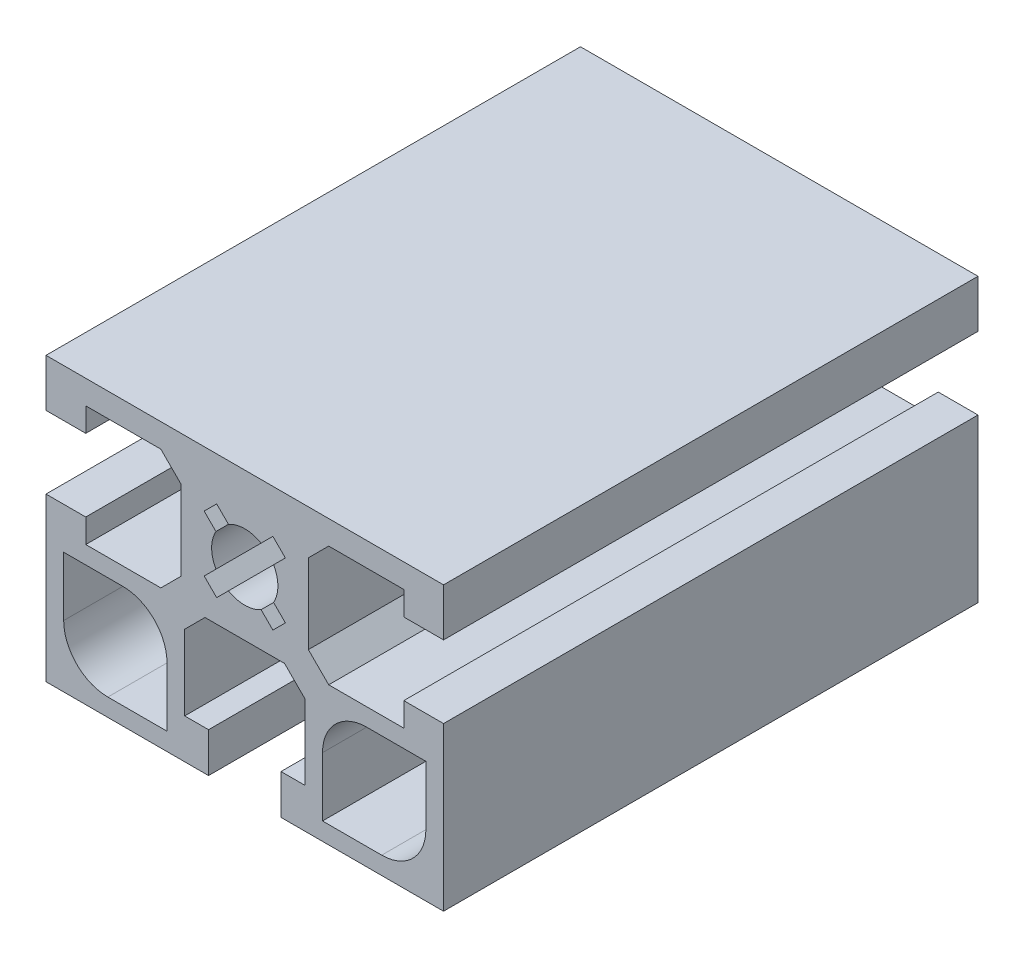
ISO-10303-21;
HEADER;
FILE_DESCRIPTION(('STEP AP214'),'2;1');
FILE_NAME('part.step','',(''),(''),'','','');
FILE_SCHEMA(('AUTOMOTIVE_DESIGN { 1 0 10303 214 1 1 1 1 }'));
ENDSEC;
DATA;
#1=APPLICATION_CONTEXT('core data for automotive mechanical design processes');
#2=APPLICATION_PROTOCOL_DEFINITION('international standard','automotive_design',2000,#1);
#3=PRODUCT_CONTEXT('',#1,'mechanical');
#4=PRODUCT('Part','Part','',(#3));
#5=PRODUCT_RELATED_PRODUCT_CATEGORY('part','',(#4));
#6=PRODUCT_DEFINITION_FORMATION('','',#4);
#7=PRODUCT_DEFINITION_CONTEXT('part definition',#1,'design');
#8=PRODUCT_DEFINITION('design','',#6,#7);
#9=PRODUCT_DEFINITION_SHAPE('','',#8);
#10=(LENGTH_UNIT() NAMED_UNIT(*) SI_UNIT(.MILLI.,.METRE.));
#11=(NAMED_UNIT(*) PLANE_ANGLE_UNIT() SI_UNIT($,.RADIAN.));
#12=(NAMED_UNIT(*) SI_UNIT($,.STERADIAN.) SOLID_ANGLE_UNIT());
#13=UNCERTAINTY_MEASURE_WITH_UNIT(LENGTH_MEASURE(1.E-05),#10,'distance_accuracy_value','');
#14=(GEOMETRIC_REPRESENTATION_CONTEXT(3) GLOBAL_UNCERTAINTY_ASSIGNED_CONTEXT((#13)) GLOBAL_UNIT_ASSIGNED_CONTEXT((#10,
#11,#12)) REPRESENTATION_CONTEXT('',''));
#15=CARTESIAN_POINT('',(0.,0.,0.));
#16=DIRECTION('',(0.,0.,1.));
#17=DIRECTION('',(1.,0.,0.));
#18=AXIS2_PLACEMENT_3D('',#15,#16,#17);
#19=CARTESIAN_POINT('',(-22.4999999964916,-4.09999999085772,-30.25));
#20=DIRECTION('',(-1.,0.,0.));
#21=DIRECTION('',(0.,0.,1.));
#22=AXIS2_PLACEMENT_3D('',#19,#20,#21);
#23=PLANE('',#22);
#24=DIRECTION('',(0.,0.,1.));
#25=VECTOR('',#24,1.);
#26=CARTESIAN_POINT('',(-22.4999999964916,-22.4999999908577,-30.25));
#27=LINE('',#26,#25);
#28=CARTESIAN_POINT('',(-22.4999999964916,-22.4999999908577,-30.25));
#29=VERTEX_POINT('',#28);
#30=CARTESIAN_POINT('',(-22.4999999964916,-22.4999999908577,30.25));
#31=VERTEX_POINT('',#30);
#32=EDGE_CURVE('E35',#29,#31,#27,.T.);
#33=ORIENTED_EDGE('',*,*,#32,.T.);
#34=DIRECTION('',(0.,-1.,0.));
#35=VECTOR('',#34,1.);
#36=CARTESIAN_POINT('',(-22.4999999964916,-4.09999999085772,30.25));
#37=LINE('',#36,#35);
#38=CARTESIAN_POINT('',(-22.4999999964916,-4.09999999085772,30.25));
#39=VERTEX_POINT('',#38);
#40=EDGE_CURVE('E524',#39,#31,#37,.T.);
#41=ORIENTED_EDGE('',*,*,#40,.F.);
#42=DIRECTION('',(0.,0.,1.));
#43=VECTOR('',#42,1.);
#44=CARTESIAN_POINT('',(-22.4999999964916,-4.09999999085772,-30.25));
#45=LINE('',#44,#43);
#46=CARTESIAN_POINT('',(-22.4999999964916,-4.09999999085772,-30.25));
#47=VERTEX_POINT('',#46);
#48=EDGE_CURVE('E11',#47,#39,#45,.T.);
#49=ORIENTED_EDGE('',*,*,#48,.F.);
#50=DIRECTION('',(0.,-1.,0.));
#51=VECTOR('',#50,1.);
#52=CARTESIAN_POINT('',(-22.4999999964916,-4.09999999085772,-30.25));
#53=LINE('',#52,#51);
#54=EDGE_CURVE('E745',#47,#29,#53,.T.);
#55=ORIENTED_EDGE('',*,*,#54,.T.);
#56=EDGE_LOOP('',(#33,#41,#49,#55));
#57=FACE_BOUND('',#56,.T.);
#58=ADVANCED_FACE('F32',(#57),#23,.T.);
#59=CARTESIAN_POINT('',(-17.9999999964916,-4.09999999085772,-30.25));
#60=DIRECTION('',(0.,1.,0.));
#61=DIRECTION('',(0.,0.,1.));
#62=AXIS2_PLACEMENT_3D('',#59,#60,#61);
#63=PLANE('',#62);
#64=ORIENTED_EDGE('',*,*,#48,.T.);
#65=DIRECTION('',(-1.,0.,0.));
#66=VECTOR('',#65,1.);
#67=CARTESIAN_POINT('',(-17.9999999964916,-4.09999999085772,30.25));
#68=LINE('',#67,#66);
#69=CARTESIAN_POINT('',(-17.9999999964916,-4.09999999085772,30.25));
#70=VERTEX_POINT('',#69);
#71=EDGE_CURVE('E623',#70,#39,#68,.T.);
#72=ORIENTED_EDGE('',*,*,#71,.F.);
#73=DIRECTION('',(0.,0.,1.));
#74=VECTOR('',#73,1.);
#75=CARTESIAN_POINT('',(-17.9999999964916,-4.09999999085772,-30.25));
#76=LINE('',#75,#74);
#77=CARTESIAN_POINT('',(-17.9999999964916,-4.09999999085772,-30.25));
#78=VERTEX_POINT('',#77);
#79=EDGE_CURVE('E40',#78,#70,#76,.T.);
#80=ORIENTED_EDGE('',*,*,#79,.F.);
#81=DIRECTION('',(-1.,0.,0.));
#82=VECTOR('',#81,1.);
#83=CARTESIAN_POINT('',(-17.9999999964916,-4.09999999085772,-30.25));
#84=LINE('',#83,#82);
#85=EDGE_CURVE('E853',#78,#47,#84,.T.);
#86=ORIENTED_EDGE('',*,*,#85,.T.);
#87=EDGE_LOOP('',(#64,#72,#80,#86));
#88=FACE_BOUND('',#87,.T.);
#89=ADVANCED_FACE('F930',(#88),#63,.T.);
#90=CARTESIAN_POINT('',(-17.9999999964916,-6.79999999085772,-30.25));
#91=DIRECTION('',(1.,0.,0.));
#92=DIRECTION('',(0.,0.,-1.));
#93=AXIS2_PLACEMENT_3D('',#90,#91,#92);
#94=PLANE('',#93);
#95=ORIENTED_EDGE('',*,*,#79,.T.);
#96=DIRECTION('',(0.,1.,0.));
#97=VECTOR('',#96,1.);
#98=CARTESIAN_POINT('',(-17.9999999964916,-6.79999999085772,30.25));
#99=LINE('',#98,#97);
#100=CARTESIAN_POINT('',(-17.9999999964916,-6.79999999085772,30.25));
#101=VERTEX_POINT('',#100);
#102=EDGE_CURVE('E620',#101,#70,#99,.T.);
#103=ORIENTED_EDGE('',*,*,#102,.F.);
#104=DIRECTION('',(0.,0.,1.));
#105=VECTOR('',#104,1.);
#106=CARTESIAN_POINT('',(-17.9999999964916,-6.79999999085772,-30.25));
#107=LINE('',#106,#105);
#108=CARTESIAN_POINT('',(-17.9999999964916,-6.79999999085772,-30.25));
#109=VERTEX_POINT('',#108);
#110=EDGE_CURVE('E857',#109,#101,#107,.T.);
#111=ORIENTED_EDGE('',*,*,#110,.F.);
#112=DIRECTION('',(0.,1.,0.));
#113=VECTOR('',#112,1.);
#114=CARTESIAN_POINT('',(-17.9999999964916,-6.79999999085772,-30.25));
#115=LINE('',#114,#113);
#116=EDGE_CURVE('E850',#109,#78,#115,.T.);
#117=ORIENTED_EDGE('',*,*,#116,.T.);
#118=EDGE_LOOP('',(#95,#103,#111,#117));
#119=FACE_BOUND('',#118,.T.);
#120=ADVANCED_FACE('F1055',(#119),#94,.T.);
#121=CARTESIAN_POINT('',(-9.49999999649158,-6.79999999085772,-30.25));
#122=DIRECTION('',(0.,1.,0.));
#123=DIRECTION('',(0.,0.,1.));
#124=AXIS2_PLACEMENT_3D('',#121,#122,#123);
#125=PLANE('',#124);
#126=ORIENTED_EDGE('',*,*,#110,.T.);
#127=DIRECTION('',(-1.,0.,0.));
#128=VECTOR('',#127,1.);
#129=CARTESIAN_POINT('',(-9.49999999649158,-6.79999999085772,30.25));
#130=LINE('',#129,#128);
#131=CARTESIAN_POINT('',(-9.49999999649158,-6.79999999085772,30.25));
#132=VERTEX_POINT('',#131);
#133=EDGE_CURVE('E617',#132,#101,#130,.T.);
#134=ORIENTED_EDGE('',*,*,#133,.F.);
#135=DIRECTION('',(0.,0.,1.));
#136=VECTOR('',#135,1.);
#137=CARTESIAN_POINT('',(-9.49999999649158,-6.79999999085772,-30.25));
#138=LINE('',#137,#136);
#139=CARTESIAN_POINT('',(-9.49999999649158,-6.79999999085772,-30.25));
#140=VERTEX_POINT('',#139);
#141=EDGE_CURVE('E859',#140,#132,#138,.T.);
#142=ORIENTED_EDGE('',*,*,#141,.F.);
#143=DIRECTION('',(-1.,0.,0.));
#144=VECTOR('',#143,1.);
#145=CARTESIAN_POINT('',(-9.49999999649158,-6.79999999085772,-30.25));
#146=LINE('',#145,#144);
#147=EDGE_CURVE('E847',#140,#109,#146,.T.);
#148=ORIENTED_EDGE('',*,*,#147,.T.);
#149=EDGE_LOOP('',(#126,#134,#142,#148));
#150=FACE_BOUND('',#149,.T.);
#151=ADVANCED_FACE('F1053',(#150),#125,.T.);
#152=CARTESIAN_POINT('',(-7.19999999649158,-4.49999999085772,-30.25));
#153=DIRECTION('',(-0.707106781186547,0.707106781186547,0.));
#154=DIRECTION('',(-0.707106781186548,-0.707106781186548,0.));
#155=AXIS2_PLACEMENT_3D('',#152,#153,#154);
#156=PLANE('',#155);
#157=ORIENTED_EDGE('',*,*,#141,.T.);
#158=DIRECTION('',(-0.707106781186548,-0.707106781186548,0.));
#159=VECTOR('',#158,1.);
#160=CARTESIAN_POINT('',(-7.19999999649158,-4.49999999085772,30.25));
#161=LINE('',#160,#159);
#162=CARTESIAN_POINT('',(-7.19999999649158,-4.49999999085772,30.25));
#163=VERTEX_POINT('',#162);
#164=EDGE_CURVE('E614',#163,#132,#161,.T.);
#165=ORIENTED_EDGE('',*,*,#164,.F.);
#166=DIRECTION('',(0.,0.,1.));
#167=VECTOR('',#166,1.);
#168=CARTESIAN_POINT('',(-7.19999999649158,-4.49999999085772,-30.25));
#169=LINE('',#168,#167);
#170=CARTESIAN_POINT('',(-7.19999999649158,-4.49999999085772,-30.25));
#171=VERTEX_POINT('',#170);
#172=EDGE_CURVE('E861',#171,#163,#169,.T.);
#173=ORIENTED_EDGE('',*,*,#172,.F.);
#174=DIRECTION('',(-0.707106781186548,-0.707106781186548,0.));
#175=VECTOR('',#174,1.);
#176=CARTESIAN_POINT('',(-7.19999999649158,-4.49999999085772,-30.25));
#177=LINE('',#176,#175);
#178=EDGE_CURVE('E844',#171,#140,#177,.T.);
#179=ORIENTED_EDGE('',*,*,#178,.T.);
#180=EDGE_LOOP('',(#157,#165,#173,#179));
#181=FACE_BOUND('',#180,.T.);
#182=ADVANCED_FACE('F1051',(#181),#156,.T.);
#183=CARTESIAN_POINT('',(-7.19999999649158,4.50000000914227,-30.25));
#184=DIRECTION('',(-1.,0.,0.));
#185=DIRECTION('',(0.,0.,1.));
#186=AXIS2_PLACEMENT_3D('',#183,#184,#185);
#187=PLANE('',#186);
#188=ORIENTED_EDGE('',*,*,#172,.T.);
#189=DIRECTION('',(0.,-1.,0.));
#190=VECTOR('',#189,1.);
#191=CARTESIAN_POINT('',(-7.19999999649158,4.50000000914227,30.25));
#192=LINE('',#191,#190);
#193=CARTESIAN_POINT('',(-7.19999999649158,4.50000000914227,30.25));
#194=VERTEX_POINT('',#193);
#195=EDGE_CURVE('E611',#194,#163,#192,.T.);
#196=ORIENTED_EDGE('',*,*,#195,.F.);
#197=DIRECTION('',(0.,0.,1.));
#198=VECTOR('',#197,1.);
#199=CARTESIAN_POINT('',(-7.19999999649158,4.50000000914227,-30.25));
#200=LINE('',#199,#198);
#201=CARTESIAN_POINT('',(-7.19999999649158,4.50000000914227,-30.25));
#202=VERTEX_POINT('',#201);
#203=EDGE_CURVE('E863',#202,#194,#200,.T.);
#204=ORIENTED_EDGE('',*,*,#203,.F.);
#205=DIRECTION('',(0.,-1.,0.));
#206=VECTOR('',#205,1.);
#207=CARTESIAN_POINT('',(-7.19999999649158,4.50000000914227,-30.25));
#208=LINE('',#207,#206);
#209=EDGE_CURVE('E841',#202,#171,#208,.T.);
#210=ORIENTED_EDGE('',*,*,#209,.T.);
#211=EDGE_LOOP('',(#188,#196,#204,#210));
#212=FACE_BOUND('',#211,.T.);
#213=ADVANCED_FACE('F1046',(#212),#187,.T.);
#214=CARTESIAN_POINT('',(-9.4999999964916,6.80000000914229,-30.25));
#215=DIRECTION('',(-0.707106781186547,-0.707106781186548,0.));
#216=DIRECTION('',(0.707106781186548,-0.707106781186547,0.));
#217=AXIS2_PLACEMENT_3D('',#214,#215,#216);
#218=PLANE('',#217);
#219=ORIENTED_EDGE('',*,*,#203,.T.);
#220=DIRECTION('',(0.707106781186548,-0.707106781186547,0.));
#221=VECTOR('',#220,1.);
#222=CARTESIAN_POINT('',(-9.4999999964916,6.80000000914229,30.25));
#223=LINE('',#222,#221);
#224=CARTESIAN_POINT('',(-9.4999999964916,6.80000000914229,30.25));
#225=VERTEX_POINT('',#224);
#226=EDGE_CURVE('E608',#225,#194,#223,.T.);
#227=ORIENTED_EDGE('',*,*,#226,.F.);
#228=DIRECTION('',(0.,0.,1.));
#229=VECTOR('',#228,1.);
#230=CARTESIAN_POINT('',(-9.4999999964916,6.80000000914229,-30.25));
#231=LINE('',#230,#229);
#232=CARTESIAN_POINT('',(-9.4999999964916,6.80000000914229,-30.25));
#233=VERTEX_POINT('',#232);
#234=EDGE_CURVE('E865',#233,#225,#231,.T.);
#235=ORIENTED_EDGE('',*,*,#234,.F.);
#236=DIRECTION('',(0.707106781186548,-0.707106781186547,0.));
#237=VECTOR('',#236,1.);
#238=CARTESIAN_POINT('',(-9.4999999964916,6.80000000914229,-30.25));
#239=LINE('',#238,#237);
#240=EDGE_CURVE('E838',#233,#202,#239,.T.);
#241=ORIENTED_EDGE('',*,*,#240,.T.);
#242=EDGE_LOOP('',(#219,#227,#235,#241));
#243=FACE_BOUND('',#242,.T.);
#244=ADVANCED_FACE('F1041',(#243),#218,.T.);
#245=CARTESIAN_POINT('',(-17.9999999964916,6.80000000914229,-30.25));
#246=DIRECTION('',(0.,-1.,0.));
#247=DIRECTION('',(0.,0.,-1.));
#248=AXIS2_PLACEMENT_3D('',#245,#246,#247);
#249=PLANE('',#248);
#250=ORIENTED_EDGE('',*,*,#234,.T.);
#251=DIRECTION('',(1.,0.,0.));
#252=VECTOR('',#251,1.);
#253=CARTESIAN_POINT('',(-17.9999999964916,6.80000000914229,30.25));
#254=LINE('',#253,#252);
#255=CARTESIAN_POINT('',(-17.9999999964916,6.80000000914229,30.25));
#256=VERTEX_POINT('',#255);
#257=EDGE_CURVE('E605',#256,#225,#254,.T.);
#258=ORIENTED_EDGE('',*,*,#257,.F.);
#259=DIRECTION('',(0.,0.,1.));
#260=VECTOR('',#259,1.);
#261=CARTESIAN_POINT('',(-17.9999999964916,6.80000000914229,-30.25));
#262=LINE('',#261,#260);
#263=CARTESIAN_POINT('',(-17.9999999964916,6.80000000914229,-30.25));
#264=VERTEX_POINT('',#263);
#265=EDGE_CURVE('E867',#264,#256,#262,.T.);
#266=ORIENTED_EDGE('',*,*,#265,.F.);
#267=DIRECTION('',(1.,0.,0.));
#268=VECTOR('',#267,1.);
#269=CARTESIAN_POINT('',(-17.9999999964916,6.80000000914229,-30.25));
#270=LINE('',#269,#268);
#271=EDGE_CURVE('E835',#264,#233,#270,.T.);
#272=ORIENTED_EDGE('',*,*,#271,.T.);
#273=EDGE_LOOP('',(#250,#258,#266,#272));
#274=FACE_BOUND('',#273,.T.);
#275=ADVANCED_FACE('F1039',(#274),#249,.T.);
#276=CARTESIAN_POINT('',(-17.9999999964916,4.10000000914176,-30.25));
#277=DIRECTION('',(1.,0.,0.));
#278=DIRECTION('',(0.,0.,-1.));
#279=AXIS2_PLACEMENT_3D('',#276,#277,#278);
#280=PLANE('',#279);
#281=ORIENTED_EDGE('',*,*,#265,.T.);
#282=DIRECTION('',(0.,1.,0.));
#283=VECTOR('',#282,1.);
#284=CARTESIAN_POINT('',(-17.9999999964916,4.10000000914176,30.25));
#285=LINE('',#284,#283);
#286=CARTESIAN_POINT('',(-17.9999999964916,4.10000000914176,30.25));
#287=VERTEX_POINT('',#286);
#288=EDGE_CURVE('E602',#287,#256,#285,.T.);
#289=ORIENTED_EDGE('',*,*,#288,.F.);
#290=DIRECTION('',(0.,0.,1.));
#291=VECTOR('',#290,1.);
#292=CARTESIAN_POINT('',(-17.9999999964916,4.10000000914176,-30.25));
#293=LINE('',#292,#291);
#294=CARTESIAN_POINT('',(-17.9999999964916,4.10000000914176,-30.25));
#295=VERTEX_POINT('',#294);
#296=EDGE_CURVE('E869',#295,#287,#293,.T.);
#297=ORIENTED_EDGE('',*,*,#296,.F.);
#298=DIRECTION('',(0.,1.,0.));
#299=VECTOR('',#298,1.);
#300=CARTESIAN_POINT('',(-17.9999999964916,4.10000000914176,-30.25));
#301=LINE('',#300,#299);
#302=EDGE_CURVE('E832',#295,#264,#301,.T.);
#303=ORIENTED_EDGE('',*,*,#302,.T.);
#304=EDGE_LOOP('',(#281,#289,#297,#303));
#305=FACE_BOUND('',#304,.T.);
#306=ADVANCED_FACE('F1034',(#305),#280,.T.);
#307=CARTESIAN_POINT('',(-22.4999999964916,4.10000000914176,-30.25));
#308=DIRECTION('',(0.,-1.,0.));
#309=DIRECTION('',(0.,0.,-1.));
#310=AXIS2_PLACEMENT_3D('',#307,#308,#309);
#311=PLANE('',#310);
#312=ORIENTED_EDGE('',*,*,#296,.T.);
#313=DIRECTION('',(1.,0.,0.));
#314=VECTOR('',#313,1.);
#315=CARTESIAN_POINT('',(-22.4999999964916,4.10000000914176,30.25));
#316=LINE('',#315,#314);
#317=CARTESIAN_POINT('',(-22.4999999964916,4.10000000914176,30.25));
#318=VERTEX_POINT('',#317);
#319=EDGE_CURVE('E599',#318,#287,#316,.T.);
#320=ORIENTED_EDGE('',*,*,#319,.F.);
#321=DIRECTION('',(0.,0.,1.));
#322=VECTOR('',#321,1.);
#323=CARTESIAN_POINT('',(-22.4999999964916,4.10000000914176,-30.25));
#324=LINE('',#323,#322);
#325=CARTESIAN_POINT('',(-22.4999999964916,4.10000000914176,-30.25));
#326=VERTEX_POINT('',#325);
#327=EDGE_CURVE('E871',#326,#318,#324,.T.);
#328=ORIENTED_EDGE('',*,*,#327,.F.);
#329=DIRECTION('',(1.,0.,0.));
#330=VECTOR('',#329,1.);
#331=CARTESIAN_POINT('',(-22.4999999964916,4.10000000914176,-30.25));
#332=LINE('',#331,#330);
#333=EDGE_CURVE('E829',#326,#295,#332,.T.);
#334=ORIENTED_EDGE('',*,*,#333,.T.);
#335=EDGE_LOOP('',(#312,#320,#328,#334));
#336=FACE_BOUND('',#335,.T.);
#337=ADVANCED_FACE('F1029',(#336),#311,.T.);
#338=CARTESIAN_POINT('',(-22.4999999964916,9.49999999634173,-30.25));
#339=DIRECTION('',(-1.,0.,0.));
#340=DIRECTION('',(0.,0.,1.));
#341=AXIS2_PLACEMENT_3D('',#338,#339,#340);
#342=PLANE('',#341);
#343=ORIENTED_EDGE('',*,*,#327,.T.);
#344=DIRECTION('',(0.,-1.,0.));
#345=VECTOR('',#344,1.);
#346=CARTESIAN_POINT('',(-22.4999999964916,9.49999999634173,30.25));
#347=LINE('',#346,#345);
#348=CARTESIAN_POINT('',(-22.4999999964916,9.49999999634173,30.25));
#349=VERTEX_POINT('',#348);
#350=EDGE_CURVE('E596',#349,#318,#347,.T.);
#351=ORIENTED_EDGE('',*,*,#350,.F.);
#352=DIRECTION('',(0.,0.,1.));
#353=VECTOR('',#352,1.);
#354=CARTESIAN_POINT('',(-22.4999999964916,9.49999999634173,-30.25));
#355=LINE('',#354,#353);
#356=CARTESIAN_POINT('',(-22.4999999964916,9.49999999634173,-30.25));
#357=VERTEX_POINT('',#356);
#358=EDGE_CURVE('E873',#357,#349,#355,.T.);
#359=ORIENTED_EDGE('',*,*,#358,.F.);
#360=DIRECTION('',(0.,-1.,0.));
#361=VECTOR('',#360,1.);
#362=CARTESIAN_POINT('',(-22.4999999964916,9.49999999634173,-30.25));
#363=LINE('',#362,#361);
#364=EDGE_CURVE('E826',#357,#326,#363,.T.);
#365=ORIENTED_EDGE('',*,*,#364,.T.);
#366=EDGE_LOOP('',(#343,#351,#359,#365));
#367=FACE_BOUND('',#366,.T.);
#368=ADVANCED_FACE('F1027',(#367),#342,.T.);
#369=CARTESIAN_POINT('',(22.4999999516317,9.49999999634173,-30.25));
#370=DIRECTION('',(0.,1.,0.));
#371=DIRECTION('',(0.,0.,1.));
#372=AXIS2_PLACEMENT_3D('',#369,#370,#371);
#373=PLANE('',#372);
#374=ORIENTED_EDGE('',*,*,#358,.T.);
#375=DIRECTION('',(-1.,0.,0.));
#376=VECTOR('',#375,1.);
#377=CARTESIAN_POINT('',(22.4999999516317,9.49999999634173,30.25));
#378=LINE('',#377,#376);
#379=CARTESIAN_POINT('',(22.4999999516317,9.49999999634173,30.25));
#380=VERTEX_POINT('',#379);
#381=EDGE_CURVE('E593',#380,#349,#378,.T.);
#382=ORIENTED_EDGE('',*,*,#381,.F.);
#383=DIRECTION('',(0.,0.,1.));
#384=VECTOR('',#383,1.);
#385=CARTESIAN_POINT('',(22.4999999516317,9.49999999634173,-30.25));
#386=LINE('',#385,#384);
#387=CARTESIAN_POINT('',(22.4999999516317,9.49999999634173,-30.25));
#388=VERTEX_POINT('',#387);
#389=EDGE_CURVE('E875',#388,#380,#386,.T.);
#390=ORIENTED_EDGE('',*,*,#389,.F.);
#391=DIRECTION('',(-1.,0.,0.));
#392=VECTOR('',#391,1.);
#393=CARTESIAN_POINT('',(22.4999999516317,9.49999999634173,-30.25));
#394=LINE('',#393,#392);
#395=EDGE_CURVE('E823',#388,#357,#394,.T.);
#396=ORIENTED_EDGE('',*,*,#395,.T.);
#397=EDGE_LOOP('',(#374,#382,#390,#396));
#398=FACE_BOUND('',#397,.T.);
#399=ADVANCED_FACE('F1022',(#398),#373,.T.);
#400=CARTESIAN_POINT('',(22.4999999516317,4.10000000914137,-30.25));
#401=DIRECTION('',(1.,0.,0.));
#402=DIRECTION('',(0.,0.,-1.));
#403=AXIS2_PLACEMENT_3D('',#400,#401,#402);
#404=PLANE('',#403);
#405=ORIENTED_EDGE('',*,*,#389,.T.);
#406=DIRECTION('',(0.,1.,0.));
#407=VECTOR('',#406,1.);
#408=CARTESIAN_POINT('',(22.4999999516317,4.10000000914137,30.25));
#409=LINE('',#408,#407);
#410=CARTESIAN_POINT('',(22.4999999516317,4.10000000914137,30.25));
#411=VERTEX_POINT('',#410);
#412=EDGE_CURVE('E590',#411,#380,#409,.T.);
#413=ORIENTED_EDGE('',*,*,#412,.F.);
#414=DIRECTION('',(0.,0.,1.));
#415=VECTOR('',#414,1.);
#416=CARTESIAN_POINT('',(22.4999999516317,4.10000000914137,-30.25));
#417=LINE('',#416,#415);
#418=CARTESIAN_POINT('',(22.4999999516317,4.10000000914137,-30.25));
#419=VERTEX_POINT('',#418);
#420=EDGE_CURVE('E877',#419,#411,#417,.T.);
#421=ORIENTED_EDGE('',*,*,#420,.F.);
#422=DIRECTION('',(0.,1.,0.));
#423=VECTOR('',#422,1.);
#424=CARTESIAN_POINT('',(22.4999999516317,4.10000000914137,-30.25));
#425=LINE('',#424,#423);
#426=EDGE_CURVE('E820',#419,#388,#425,.T.);
#427=ORIENTED_EDGE('',*,*,#426,.T.);
#428=EDGE_LOOP('',(#405,#413,#421,#427));
#429=FACE_BOUND('',#428,.T.);
#430=ADVANCED_FACE('F1017',(#429),#404,.T.);
#431=CARTESIAN_POINT('',(17.9999999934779,4.10000000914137,-30.25));
#432=DIRECTION('',(0.,-1.,0.));
#433=DIRECTION('',(0.,0.,-1.));
#434=AXIS2_PLACEMENT_3D('',#431,#432,#433);
#435=PLANE('',#434);
#436=ORIENTED_EDGE('',*,*,#420,.T.);
#437=DIRECTION('',(1.,0.,0.));
#438=VECTOR('',#437,1.);
#439=CARTESIAN_POINT('',(17.9999999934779,4.10000000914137,30.25));
#440=LINE('',#439,#438);
#441=CARTESIAN_POINT('',(17.9999999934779,4.10000000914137,30.25));
#442=VERTEX_POINT('',#441);
#443=EDGE_CURVE('E587',#442,#411,#440,.T.);
#444=ORIENTED_EDGE('',*,*,#443,.F.);
#445=DIRECTION('',(0.,0.,1.));
#446=VECTOR('',#445,1.);
#447=CARTESIAN_POINT('',(17.9999999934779,4.10000000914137,-30.25));
#448=LINE('',#447,#446);
#449=CARTESIAN_POINT('',(17.9999999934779,4.10000000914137,-30.25));
#450=VERTEX_POINT('',#449);
#451=EDGE_CURVE('E879',#450,#442,#448,.T.);
#452=ORIENTED_EDGE('',*,*,#451,.F.);
#453=DIRECTION('',(1.,0.,0.));
#454=VECTOR('',#453,1.);
#455=CARTESIAN_POINT('',(17.9999999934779,4.10000000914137,-30.25));
#456=LINE('',#455,#454);
#457=EDGE_CURVE('E817',#450,#419,#456,.T.);
#458=ORIENTED_EDGE('',*,*,#457,.T.);
#459=EDGE_LOOP('',(#436,#444,#452,#458));
#460=FACE_BOUND('',#459,.T.);
#461=ADVANCED_FACE('F1015',(#460),#435,.T.);
#462=CARTESIAN_POINT('',(17.9999999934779,6.80000000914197,-30.25));
#463=DIRECTION('',(-1.,0.,0.));
#464=DIRECTION('',(0.,0.,1.));
#465=AXIS2_PLACEMENT_3D('',#462,#463,#464);
#466=PLANE('',#465);
#467=ORIENTED_EDGE('',*,*,#451,.T.);
#468=DIRECTION('',(0.,-1.,0.));
#469=VECTOR('',#468,1.);
#470=CARTESIAN_POINT('',(17.9999999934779,6.80000000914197,30.25));
#471=LINE('',#470,#469);
#472=CARTESIAN_POINT('',(17.9999999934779,6.80000000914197,30.25));
#473=VERTEX_POINT('',#472);
#474=EDGE_CURVE('E584',#473,#442,#471,.T.);
#475=ORIENTED_EDGE('',*,*,#474,.F.);
#476=DIRECTION('',(0.,0.,1.));
#477=VECTOR('',#476,1.);
#478=CARTESIAN_POINT('',(17.9999999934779,6.80000000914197,-30.25));
#479=LINE('',#478,#477);
#480=CARTESIAN_POINT('',(17.9999999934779,6.80000000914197,-30.25));
#481=VERTEX_POINT('',#480);
#482=EDGE_CURVE('E881',#481,#473,#479,.T.);
#483=ORIENTED_EDGE('',*,*,#482,.F.);
#484=DIRECTION('',(0.,-1.,0.));
#485=VECTOR('',#484,1.);
#486=CARTESIAN_POINT('',(17.9999999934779,6.80000000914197,-30.25));
#487=LINE('',#486,#485);
#488=EDGE_CURVE('E814',#481,#450,#487,.T.);
#489=ORIENTED_EDGE('',*,*,#488,.T.);
#490=EDGE_LOOP('',(#467,#475,#483,#489));
#491=FACE_BOUND('',#490,.T.);
#492=ADVANCED_FACE('F1010',(#491),#466,.T.);
#493=CARTESIAN_POINT('',(9.49999999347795,6.80000000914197,-30.25));
#494=DIRECTION('',(0.,-1.,0.));
#495=DIRECTION('',(0.,0.,-1.));
#496=AXIS2_PLACEMENT_3D('',#493,#494,#495);
#497=PLANE('',#496);
#498=ORIENTED_EDGE('',*,*,#482,.T.);
#499=DIRECTION('',(1.,0.,0.));
#500=VECTOR('',#499,1.);
#501=CARTESIAN_POINT('',(9.49999999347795,6.80000000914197,30.25));
#502=LINE('',#501,#500);
#503=CARTESIAN_POINT('',(9.49999999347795,6.80000000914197,30.25));
#504=VERTEX_POINT('',#503);
#505=EDGE_CURVE('E581',#504,#473,#502,.T.);
#506=ORIENTED_EDGE('',*,*,#505,.F.);
#507=DIRECTION('',(0.,0.,1.));
#508=VECTOR('',#507,1.);
#509=CARTESIAN_POINT('',(9.49999999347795,6.80000000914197,-30.25));
#510=LINE('',#509,#508);
#511=CARTESIAN_POINT('',(9.49999999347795,6.80000000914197,-30.25));
#512=VERTEX_POINT('',#511);
#513=EDGE_CURVE('E883',#512,#504,#510,.T.);
#514=ORIENTED_EDGE('',*,*,#513,.F.);
#515=DIRECTION('',(1.,0.,0.));
#516=VECTOR('',#515,1.);
#517=CARTESIAN_POINT('',(9.49999999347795,6.80000000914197,-30.25));
#518=LINE('',#517,#516);
#519=EDGE_CURVE('E811',#512,#481,#518,.T.);
#520=ORIENTED_EDGE('',*,*,#519,.T.);
#521=EDGE_LOOP('',(#498,#506,#514,#520));
#522=FACE_BOUND('',#521,.T.);
#523=ADVANCED_FACE('F1005',(#522),#497,.T.);
#524=CARTESIAN_POINT('',(7.19999999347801,4.50000000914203,-30.25));
#525=DIRECTION('',(0.707106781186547,-0.707106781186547,0.));
#526=DIRECTION('',(0.707106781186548,0.707106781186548,0.));
#527=AXIS2_PLACEMENT_3D('',#524,#525,#526);
#528=PLANE('',#527);
#529=ORIENTED_EDGE('',*,*,#513,.T.);
#530=DIRECTION('',(0.707106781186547,0.707106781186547,0.));
#531=VECTOR('',#530,1.);
#532=CARTESIAN_POINT('',(7.19999999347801,4.50000000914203,30.25));
#533=LINE('',#532,#531);
#534=CARTESIAN_POINT('',(7.19999999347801,4.50000000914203,30.25));
#535=VERTEX_POINT('',#534);
#536=EDGE_CURVE('E578',#535,#504,#533,.T.);
#537=ORIENTED_EDGE('',*,*,#536,.F.);
#538=DIRECTION('',(0.,0.,1.));
#539=VECTOR('',#538,1.);
#540=CARTESIAN_POINT('',(7.19999999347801,4.50000000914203,-30.25));
#541=LINE('',#540,#539);
#542=CARTESIAN_POINT('',(7.19999999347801,4.50000000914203,-30.25));
#543=VERTEX_POINT('',#542);
#544=EDGE_CURVE('E885',#543,#535,#541,.T.);
#545=ORIENTED_EDGE('',*,*,#544,.F.);
#546=DIRECTION('',(0.707106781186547,0.707106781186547,0.));
#547=VECTOR('',#546,1.);
#548=CARTESIAN_POINT('',(7.19999999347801,4.50000000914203,-30.25));
#549=LINE('',#548,#547);
#550=EDGE_CURVE('E808',#543,#512,#549,.T.);
#551=ORIENTED_EDGE('',*,*,#550,.T.);
#552=EDGE_LOOP('',(#529,#537,#545,#551));
#553=FACE_BOUND('',#552,.T.);
#554=ADVANCED_FACE('F1003',(#553),#528,.T.);
#555=CARTESIAN_POINT('',(7.19999999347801,-4.49999999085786,-30.25));
#556=DIRECTION('',(1.,0.,0.));
#557=DIRECTION('',(0.,0.,-1.));
#558=AXIS2_PLACEMENT_3D('',#555,#556,#557);
#559=PLANE('',#558);
#560=ORIENTED_EDGE('',*,*,#544,.T.);
#561=DIRECTION('',(0.,1.,0.));
#562=VECTOR('',#561,1.);
#563=CARTESIAN_POINT('',(7.19999999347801,-4.49999999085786,30.25));
#564=LINE('',#563,#562);
#565=CARTESIAN_POINT('',(7.19999999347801,-4.49999999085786,30.25));
#566=VERTEX_POINT('',#565);
#567=EDGE_CURVE('E575',#566,#535,#564,.T.);
#568=ORIENTED_EDGE('',*,*,#567,.F.);
#569=DIRECTION('',(0.,0.,1.));
#570=VECTOR('',#569,1.);
#571=CARTESIAN_POINT('',(7.19999999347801,-4.49999999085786,-30.25));
#572=LINE('',#571,#570);
#573=CARTESIAN_POINT('',(7.19999999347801,-4.49999999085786,-30.25));
#574=VERTEX_POINT('',#573);
#575=EDGE_CURVE('E887',#574,#566,#572,.T.);
#576=ORIENTED_EDGE('',*,*,#575,.F.);
#577=DIRECTION('',(0.,1.,0.));
#578=VECTOR('',#577,1.);
#579=CARTESIAN_POINT('',(7.19999999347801,-4.49999999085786,-30.25));
#580=LINE('',#579,#578);
#581=EDGE_CURVE('E805',#574,#543,#580,.T.);
#582=ORIENTED_EDGE('',*,*,#581,.T.);
#583=EDGE_LOOP('',(#560,#568,#576,#582));
#584=FACE_BOUND('',#583,.T.);
#585=ADVANCED_FACE('F998',(#584),#559,.T.);
#586=CARTESIAN_POINT('',(9.4999999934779,-6.79999999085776,-30.25));
#587=DIRECTION('',(0.707106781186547,0.707106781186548,0.));
#588=DIRECTION('',(-0.707106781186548,0.707106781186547,0.));
#589=AXIS2_PLACEMENT_3D('',#586,#587,#588);
#590=PLANE('',#589);
#591=ORIENTED_EDGE('',*,*,#575,.T.);
#592=DIRECTION('',(-0.707106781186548,0.707106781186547,0.));
#593=VECTOR('',#592,1.);
#594=CARTESIAN_POINT('',(9.4999999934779,-6.79999999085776,30.25));
#595=LINE('',#594,#593);
#596=CARTESIAN_POINT('',(9.4999999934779,-6.79999999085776,30.25));
#597=VERTEX_POINT('',#596);
#598=EDGE_CURVE('E572',#597,#566,#595,.T.);
#599=ORIENTED_EDGE('',*,*,#598,.F.);
#600=DIRECTION('',(0.,0.,1.));
#601=VECTOR('',#600,1.);
#602=CARTESIAN_POINT('',(9.4999999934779,-6.79999999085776,-30.25));
#603=LINE('',#602,#601);
#604=CARTESIAN_POINT('',(9.4999999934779,-6.79999999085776,-30.25));
#605=VERTEX_POINT('',#604);
#606=EDGE_CURVE('E889',#605,#597,#603,.T.);
#607=ORIENTED_EDGE('',*,*,#606,.F.);
#608=DIRECTION('',(-0.707106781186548,0.707106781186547,0.));
#609=VECTOR('',#608,1.);
#610=CARTESIAN_POINT('',(9.4999999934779,-6.79999999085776,-30.25));
#611=LINE('',#610,#609);
#612=EDGE_CURVE('E802',#605,#574,#611,.T.);
#613=ORIENTED_EDGE('',*,*,#612,.T.);
#614=EDGE_LOOP('',(#591,#599,#607,#613));
#615=FACE_BOUND('',#614,.T.);
#616=ADVANCED_FACE('F993',(#615),#590,.T.);
#617=CARTESIAN_POINT('',(17.9999999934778,-6.79999999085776,-30.25));
#618=DIRECTION('',(0.,1.,0.));
#619=DIRECTION('',(0.,0.,1.));
#620=AXIS2_PLACEMENT_3D('',#617,#618,#619);
#621=PLANE('',#620);
#622=ORIENTED_EDGE('',*,*,#606,.T.);
#623=DIRECTION('',(-1.,0.,0.));
#624=VECTOR('',#623,1.);
#625=CARTESIAN_POINT('',(17.9999999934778,-6.79999999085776,30.25));
#626=LINE('',#625,#624);
#627=CARTESIAN_POINT('',(17.9999999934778,-6.79999999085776,30.25));
#628=VERTEX_POINT('',#627);
#629=EDGE_CURVE('E569',#628,#597,#626,.T.);
#630=ORIENTED_EDGE('',*,*,#629,.F.);
#631=DIRECTION('',(0.,0.,1.));
#632=VECTOR('',#631,1.);
#633=CARTESIAN_POINT('',(17.9999999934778,-6.79999999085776,-30.25));
#634=LINE('',#633,#632);
#635=CARTESIAN_POINT('',(17.9999999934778,-6.79999999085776,-30.25));
#636=VERTEX_POINT('',#635);
#637=EDGE_CURVE('E891',#636,#628,#634,.T.);
#638=ORIENTED_EDGE('',*,*,#637,.F.);
#639=DIRECTION('',(-1.,0.,0.));
#640=VECTOR('',#639,1.);
#641=CARTESIAN_POINT('',(17.9999999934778,-6.79999999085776,-30.25));
#642=LINE('',#641,#640);
#643=EDGE_CURVE('E799',#636,#605,#642,.T.);
#644=ORIENTED_EDGE('',*,*,#643,.T.);
#645=EDGE_LOOP('',(#622,#630,#638,#644));
#646=FACE_BOUND('',#645,.T.);
#647=ADVANCED_FACE('F991',(#646),#621,.T.);
#648=CARTESIAN_POINT('',(17.9999999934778,-4.09999999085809,-30.25));
#649=DIRECTION('',(-1.,0.,0.));
#650=DIRECTION('',(0.,0.,1.));
#651=AXIS2_PLACEMENT_3D('',#648,#649,#650);
#652=PLANE('',#651);
#653=ORIENTED_EDGE('',*,*,#637,.T.);
#654=DIRECTION('',(0.,-1.,0.));
#655=VECTOR('',#654,1.);
#656=CARTESIAN_POINT('',(17.9999999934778,-4.09999999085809,30.25));
#657=LINE('',#656,#655);
#658=CARTESIAN_POINT('',(17.9999999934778,-4.09999999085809,30.25));
#659=VERTEX_POINT('',#658);
#660=EDGE_CURVE('E566',#659,#628,#657,.T.);
#661=ORIENTED_EDGE('',*,*,#660,.F.);
#662=DIRECTION('',(0.,0.,1.));
#663=VECTOR('',#662,1.);
#664=CARTESIAN_POINT('',(17.9999999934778,-4.09999999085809,-30.25));
#665=LINE('',#664,#663);
#666=CARTESIAN_POINT('',(17.9999999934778,-4.09999999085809,-30.25));
#667=VERTEX_POINT('',#666);
#668=EDGE_CURVE('E893',#667,#659,#665,.T.);
#669=ORIENTED_EDGE('',*,*,#668,.F.);
#670=DIRECTION('',(0.,-1.,0.));
#671=VECTOR('',#670,1.);
#672=CARTESIAN_POINT('',(17.9999999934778,-4.09999999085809,-30.25));
#673=LINE('',#672,#671);
#674=EDGE_CURVE('E796',#667,#636,#673,.T.);
#675=ORIENTED_EDGE('',*,*,#674,.T.);
#676=EDGE_LOOP('',(#653,#661,#669,#675));
#677=FACE_BOUND('',#676,.T.);
#678=ADVANCED_FACE('F986',(#677),#652,.T.);
#679=CARTESIAN_POINT('',(22.4999999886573,-4.09999999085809,-30.25));
#680=DIRECTION('',(0.,1.,0.));
#681=DIRECTION('',(0.,0.,1.));
#682=AXIS2_PLACEMENT_3D('',#679,#680,#681);
#683=PLANE('',#682);
#684=ORIENTED_EDGE('',*,*,#668,.T.);
#685=DIRECTION('',(-1.,0.,0.));
#686=VECTOR('',#685,1.);
#687=CARTESIAN_POINT('',(22.4999999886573,-4.09999999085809,30.25));
#688=LINE('',#687,#686);
#689=CARTESIAN_POINT('',(22.4999999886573,-4.09999999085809,30.25));
#690=VERTEX_POINT('',#689);
#691=EDGE_CURVE('E563',#690,#659,#688,.T.);
#692=ORIENTED_EDGE('',*,*,#691,.F.);
#693=DIRECTION('',(0.,0.,1.));
#694=VECTOR('',#693,1.);
#695=CARTESIAN_POINT('',(22.4999999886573,-4.09999999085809,-30.25));
#696=LINE('',#695,#694);
#697=CARTESIAN_POINT('',(22.4999999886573,-4.09999999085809,-30.25));
#698=VERTEX_POINT('',#697);
#699=EDGE_CURVE('E895',#698,#690,#696,.T.);
#700=ORIENTED_EDGE('',*,*,#699,.F.);
#701=DIRECTION('',(-1.,0.,0.));
#702=VECTOR('',#701,1.);
#703=CARTESIAN_POINT('',(22.4999999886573,-4.09999999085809,-30.25));
#704=LINE('',#703,#702);
#705=EDGE_CURVE('E793',#698,#667,#704,.T.);
#706=ORIENTED_EDGE('',*,*,#705,.T.);
#707=EDGE_LOOP('',(#684,#692,#700,#706));
#708=FACE_BOUND('',#707,.T.);
#709=ADVANCED_FACE('F981',(#708),#683,.T.);
#710=CARTESIAN_POINT('',(22.4999999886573,-22.4999999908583,-30.25));
#711=DIRECTION('',(1.,0.,0.));
#712=DIRECTION('',(0.,0.,-1.));
#713=AXIS2_PLACEMENT_3D('',#710,#711,#712);
#714=PLANE('',#713);
#715=ORIENTED_EDGE('',*,*,#699,.T.);
#716=DIRECTION('',(0.,1.,0.));
#717=VECTOR('',#716,1.);
#718=CARTESIAN_POINT('',(22.4999999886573,-22.4999999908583,30.25));
#719=LINE('',#718,#717);
#720=CARTESIAN_POINT('',(22.4999999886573,-22.4999999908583,30.25));
#721=VERTEX_POINT('',#720);
#722=EDGE_CURVE('E560',#721,#690,#719,.T.);
#723=ORIENTED_EDGE('',*,*,#722,.F.);
#724=DIRECTION('',(0.,0.,1.));
#725=VECTOR('',#724,1.);
#726=CARTESIAN_POINT('',(22.4999999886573,-22.4999999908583,-30.25));
#727=LINE('',#726,#725);
#728=CARTESIAN_POINT('',(22.4999999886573,-22.4999999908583,-30.25));
#729=VERTEX_POINT('',#728);
#730=EDGE_CURVE('E897',#729,#721,#727,.T.);
#731=ORIENTED_EDGE('',*,*,#730,.F.);
#732=DIRECTION('',(0.,1.,0.));
#733=VECTOR('',#732,1.);
#734=CARTESIAN_POINT('',(22.4999999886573,-22.4999999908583,-30.25));
#735=LINE('',#734,#733);
#736=EDGE_CURVE('E790',#729,#698,#735,.T.);
#737=ORIENTED_EDGE('',*,*,#736,.T.);
#738=EDGE_LOOP('',(#715,#723,#731,#737));
#739=FACE_BOUND('',#738,.T.);
#740=ADVANCED_FACE('F979',(#739),#714,.T.);
#741=CARTESIAN_POINT('',(4.10000000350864,-22.4999999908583,-30.25));
#742=DIRECTION('',(0.,-1.,0.));
#743=DIRECTION('',(0.,0.,-1.));
#744=AXIS2_PLACEMENT_3D('',#741,#742,#743);
#745=PLANE('',#744);
#746=ORIENTED_EDGE('',*,*,#730,.T.);
#747=DIRECTION('',(1.,0.,0.));
#748=VECTOR('',#747,1.);
#749=CARTESIAN_POINT('',(4.10000000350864,-22.4999999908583,30.25));
#750=LINE('',#749,#748);
#751=CARTESIAN_POINT('',(4.10000000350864,-22.4999999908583,30.25));
#752=VERTEX_POINT('',#751);
#753=EDGE_CURVE('E557',#752,#721,#750,.T.);
#754=ORIENTED_EDGE('',*,*,#753,.F.);
#755=DIRECTION('',(0.,0.,1.));
#756=VECTOR('',#755,1.);
#757=CARTESIAN_POINT('',(4.10000000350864,-22.4999999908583,-30.25));
#758=LINE('',#757,#756);
#759=CARTESIAN_POINT('',(4.10000000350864,-22.4999999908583,-30.25));
#760=VERTEX_POINT('',#759);
#761=EDGE_CURVE('E899',#760,#752,#758,.T.);
#762=ORIENTED_EDGE('',*,*,#761,.F.);
#763=DIRECTION('',(1.,0.,0.));
#764=VECTOR('',#763,1.);
#765=CARTESIAN_POINT('',(4.10000000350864,-22.4999999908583,-30.25));
#766=LINE('',#765,#764);
#767=EDGE_CURVE('E787',#760,#729,#766,.T.);
#768=ORIENTED_EDGE('',*,*,#767,.T.);
#769=EDGE_LOOP('',(#746,#754,#762,#768));
#770=FACE_BOUND('',#769,.T.);
#771=ADVANCED_FACE('F974',(#770),#745,.T.);
#772=CARTESIAN_POINT('',(4.10000000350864,-17.9999999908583,-30.25));
#773=DIRECTION('',(-1.,0.,0.));
#774=DIRECTION('',(0.,0.,1.));
#775=AXIS2_PLACEMENT_3D('',#772,#773,#774);
#776=PLANE('',#775);
#777=ORIENTED_EDGE('',*,*,#761,.T.);
#778=DIRECTION('',(0.,-1.,0.));
#779=VECTOR('',#778,1.);
#780=CARTESIAN_POINT('',(4.10000000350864,-17.9999999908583,30.25));
#781=LINE('',#780,#779);
#782=CARTESIAN_POINT('',(4.10000000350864,-17.9999999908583,30.25));
#783=VERTEX_POINT('',#782);
#784=EDGE_CURVE('E554',#783,#752,#781,.T.);
#785=ORIENTED_EDGE('',*,*,#784,.F.);
#786=DIRECTION('',(0.,0.,1.));
#787=VECTOR('',#786,1.);
#788=CARTESIAN_POINT('',(4.10000000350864,-17.9999999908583,-30.25));
#789=LINE('',#788,#787);
#790=CARTESIAN_POINT('',(4.10000000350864,-17.9999999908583,-30.25));
#791=VERTEX_POINT('',#790);
#792=EDGE_CURVE('E901',#791,#783,#789,.T.);
#793=ORIENTED_EDGE('',*,*,#792,.F.);
#794=DIRECTION('',(0.,-1.,0.));
#795=VECTOR('',#794,1.);
#796=CARTESIAN_POINT('',(4.10000000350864,-17.9999999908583,-30.25));
#797=LINE('',#796,#795);
#798=EDGE_CURVE('E784',#791,#760,#797,.T.);
#799=ORIENTED_EDGE('',*,*,#798,.T.);
#800=EDGE_LOOP('',(#777,#785,#793,#799));
#801=FACE_BOUND('',#800,.T.);
#802=ADVANCED_FACE('F969',(#801),#776,.T.);
#803=CARTESIAN_POINT('',(6.80000000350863,-17.9999999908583,-30.25));
#804=DIRECTION('',(0.,1.,0.));
#805=DIRECTION('',(-1.,0.,0.));
#806=AXIS2_PLACEMENT_3D('',#803,#804,#805);
#807=PLANE('',#806);
#808=ORIENTED_EDGE('',*,*,#792,.T.);
#809=DIRECTION('',(-1.,0.,0.));
#810=VECTOR('',#809,1.);
#811=CARTESIAN_POINT('',(6.80000000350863,-17.9999999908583,30.25));
#812=LINE('',#811,#810);
#813=CARTESIAN_POINT('',(6.80000000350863,-17.9999999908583,30.25));
#814=VERTEX_POINT('',#813);
#815=EDGE_CURVE('E551',#814,#783,#812,.T.);
#816=ORIENTED_EDGE('',*,*,#815,.F.);
#817=DIRECTION('',(0.,0.,1.));
#818=VECTOR('',#817,1.);
#819=CARTESIAN_POINT('',(6.80000000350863,-17.9999999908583,-30.25));
#820=LINE('',#819,#818);
#821=CARTESIAN_POINT('',(6.80000000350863,-17.9999999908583,-30.25));
#822=VERTEX_POINT('',#821);
#823=EDGE_CURVE('E903',#822,#814,#820,.T.);
#824=ORIENTED_EDGE('',*,*,#823,.F.);
#825=DIRECTION('',(-1.,0.,0.));
#826=VECTOR('',#825,1.);
#827=CARTESIAN_POINT('',(6.80000000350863,-17.9999999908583,-30.25));
#828=LINE('',#827,#826);
#829=EDGE_CURVE('E781',#822,#791,#828,.T.);
#830=ORIENTED_EDGE('',*,*,#829,.T.);
#831=EDGE_LOOP('',(#808,#816,#824,#830));
#832=FACE_BOUND('',#831,.T.);
#833=ADVANCED_FACE('F967',(#832),#807,.T.);
#834=CARTESIAN_POINT('',(6.80000000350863,-9.49999999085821,-30.25));
#835=DIRECTION('',(-1.,0.,0.));
#836=DIRECTION('',(0.,0.,1.));
#837=AXIS2_PLACEMENT_3D('',#834,#835,#836);
#838=PLANE('',#837);
#839=ORIENTED_EDGE('',*,*,#823,.T.);
#840=DIRECTION('',(0.,-1.,0.));
#841=VECTOR('',#840,1.);
#842=CARTESIAN_POINT('',(6.80000000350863,-9.49999999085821,30.25));
#843=LINE('',#842,#841);
#844=CARTESIAN_POINT('',(6.80000000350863,-9.49999999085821,30.25));
#845=VERTEX_POINT('',#844);
#846=EDGE_CURVE('E548',#845,#814,#843,.T.);
#847=ORIENTED_EDGE('',*,*,#846,.F.);
#848=DIRECTION('',(0.,0.,1.));
#849=VECTOR('',#848,1.);
#850=CARTESIAN_POINT('',(6.80000000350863,-9.49999999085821,-30.25));
#851=LINE('',#850,#849);
#852=CARTESIAN_POINT('',(6.80000000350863,-9.49999999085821,-30.25));
#853=VERTEX_POINT('',#852);
#854=EDGE_CURVE('E905',#853,#845,#851,.T.);
#855=ORIENTED_EDGE('',*,*,#854,.F.);
#856=DIRECTION('',(0.,-1.,0.));
#857=VECTOR('',#856,1.);
#858=CARTESIAN_POINT('',(6.80000000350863,-9.49999999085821,-30.25));
#859=LINE('',#858,#857);
#860=EDGE_CURVE('E778',#853,#822,#859,.T.);
#861=ORIENTED_EDGE('',*,*,#860,.T.);
#862=EDGE_LOOP('',(#839,#847,#855,#861));
#863=FACE_BOUND('',#862,.T.);
#864=ADVANCED_FACE('F962',(#863),#838,.T.);
#865=CARTESIAN_POINT('',(4.50000000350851,-7.19999999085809,-30.25));
#866=DIRECTION('',(-0.707106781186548,-0.707106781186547,0.));
#867=DIRECTION('',(0.707106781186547,-0.707106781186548,0.));
#868=AXIS2_PLACEMENT_3D('',#865,#866,#867);
#869=PLANE('',#868);
#870=ORIENTED_EDGE('',*,*,#854,.T.);
#871=DIRECTION('',(0.707106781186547,-0.707106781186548,0.));
#872=VECTOR('',#871,1.);
#873=CARTESIAN_POINT('',(4.50000000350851,-7.19999999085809,30.25));
#874=LINE('',#873,#872);
#875=CARTESIAN_POINT('',(4.50000000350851,-7.19999999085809,30.25));
#876=VERTEX_POINT('',#875);
#877=EDGE_CURVE('E545',#876,#845,#874,.T.);
#878=ORIENTED_EDGE('',*,*,#877,.F.);
#879=DIRECTION('',(0.,0.,1.));
#880=VECTOR('',#879,1.);
#881=CARTESIAN_POINT('',(4.50000000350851,-7.19999999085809,-30.25));
#882=LINE('',#881,#880);
#883=CARTESIAN_POINT('',(4.50000000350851,-7.19999999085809,-30.25));
#884=VERTEX_POINT('',#883);
#885=EDGE_CURVE('E907',#884,#876,#882,.T.);
#886=ORIENTED_EDGE('',*,*,#885,.F.);
#887=DIRECTION('',(0.707106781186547,-0.707106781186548,0.));
#888=VECTOR('',#887,1.);
#889=CARTESIAN_POINT('',(4.50000000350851,-7.19999999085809,-30.25));
#890=LINE('',#889,#888);
#891=EDGE_CURVE('E775',#884,#853,#890,.T.);
#892=ORIENTED_EDGE('',*,*,#891,.T.);
#893=EDGE_LOOP('',(#870,#878,#886,#892));
#894=FACE_BOUND('',#893,.T.);
#895=ADVANCED_FACE('F957',(#894),#869,.T.);
#896=CARTESIAN_POINT('',(-4.49999999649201,-7.19999999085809,-30.25));
#897=DIRECTION('',(0.,-1.,0.));
#898=DIRECTION('',(0.,0.,-1.));
#899=AXIS2_PLACEMENT_3D('',#896,#897,#898);
#900=PLANE('',#899);
#901=ORIENTED_EDGE('',*,*,#885,.T.);
#902=DIRECTION('',(1.,0.,0.));
#903=VECTOR('',#902,1.);
#904=CARTESIAN_POINT('',(-4.49999999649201,-7.19999999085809,30.25));
#905=LINE('',#904,#903);
#906=CARTESIAN_POINT('',(-4.49999999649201,-7.19999999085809,30.25));
#907=VERTEX_POINT('',#906);
#908=EDGE_CURVE('E542',#907,#876,#905,.T.);
#909=ORIENTED_EDGE('',*,*,#908,.F.);
#910=DIRECTION('',(0.,0.,1.));
#911=VECTOR('',#910,1.);
#912=CARTESIAN_POINT('',(-4.49999999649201,-7.19999999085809,-30.25));
#913=LINE('',#912,#911);
#914=CARTESIAN_POINT('',(-4.49999999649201,-7.19999999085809,-30.25));
#915=VERTEX_POINT('',#914);
#916=EDGE_CURVE('E909',#915,#907,#913,.T.);
#917=ORIENTED_EDGE('',*,*,#916,.F.);
#918=DIRECTION('',(1.,0.,0.));
#919=VECTOR('',#918,1.);
#920=CARTESIAN_POINT('',(-4.49999999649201,-7.19999999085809,-30.25));
#921=LINE('',#920,#919);
#922=EDGE_CURVE('E772',#915,#884,#921,.T.);
#923=ORIENTED_EDGE('',*,*,#922,.T.);
#924=EDGE_LOOP('',(#901,#909,#917,#923));
#925=FACE_BOUND('',#924,.T.);
#926=ADVANCED_FACE('F955',(#925),#900,.T.);
#927=CARTESIAN_POINT('',(-6.79999999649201,-9.49999999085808,-30.25));
#928=DIRECTION('',(0.707106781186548,-0.707106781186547,0.));
#929=DIRECTION('',(0.707106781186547,0.707106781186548,0.));
#930=AXIS2_PLACEMENT_3D('',#927,#928,#929);
#931=PLANE('',#930);
#932=ORIENTED_EDGE('',*,*,#916,.T.);
#933=DIRECTION('',(0.707106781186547,0.707106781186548,0.));
#934=VECTOR('',#933,1.);
#935=CARTESIAN_POINT('',(-6.79999999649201,-9.49999999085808,30.25));
#936=LINE('',#935,#934);
#937=CARTESIAN_POINT('',(-6.79999999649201,-9.49999999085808,30.25));
#938=VERTEX_POINT('',#937);
#939=EDGE_CURVE('E539',#938,#907,#936,.T.);
#940=ORIENTED_EDGE('',*,*,#939,.F.);
#941=DIRECTION('',(0.,0.,1.));
#942=VECTOR('',#941,1.);
#943=CARTESIAN_POINT('',(-6.79999999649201,-9.49999999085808,-30.25));
#944=LINE('',#943,#942);
#945=CARTESIAN_POINT('',(-6.79999999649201,-9.49999999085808,-30.25));
#946=VERTEX_POINT('',#945);
#947=EDGE_CURVE('E911',#946,#938,#944,.T.);
#948=ORIENTED_EDGE('',*,*,#947,.F.);
#949=DIRECTION('',(0.707106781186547,0.707106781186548,0.));
#950=VECTOR('',#949,1.);
#951=CARTESIAN_POINT('',(-6.79999999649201,-9.49999999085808,-30.25));
#952=LINE('',#951,#950);
#953=EDGE_CURVE('E769',#946,#915,#952,.T.);
#954=ORIENTED_EDGE('',*,*,#953,.T.);
#955=EDGE_LOOP('',(#932,#940,#948,#954));
#956=FACE_BOUND('',#955,.T.);
#957=ADVANCED_FACE('F950',(#956),#931,.T.);
#958=CARTESIAN_POINT('',(-6.79999999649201,-17.9999999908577,-30.25));
#959=DIRECTION('',(1.,0.,0.));
#960=DIRECTION('',(0.,0.,-1.));
#961=AXIS2_PLACEMENT_3D('',#958,#959,#960);
#962=PLANE('',#961);
#963=ORIENTED_EDGE('',*,*,#947,.T.);
#964=DIRECTION('',(0.,1.,0.));
#965=VECTOR('',#964,1.);
#966=CARTESIAN_POINT('',(-6.79999999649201,-17.9999999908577,30.25));
#967=LINE('',#966,#965);
#968=CARTESIAN_POINT('',(-6.79999999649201,-17.9999999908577,30.25));
#969=VERTEX_POINT('',#968);
#970=EDGE_CURVE('E536',#969,#938,#967,.T.);
#971=ORIENTED_EDGE('',*,*,#970,.F.);
#972=DIRECTION('',(0.,0.,1.));
#973=VECTOR('',#972,1.);
#974=CARTESIAN_POINT('',(-6.79999999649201,-17.9999999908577,-30.25));
#975=LINE('',#974,#973);
#976=CARTESIAN_POINT('',(-6.79999999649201,-17.9999999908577,-30.25));
#977=VERTEX_POINT('',#976);
#978=EDGE_CURVE('E913',#977,#969,#975,.T.);
#979=ORIENTED_EDGE('',*,*,#978,.F.);
#980=DIRECTION('',(0.,1.,0.));
#981=VECTOR('',#980,1.);
#982=CARTESIAN_POINT('',(-6.79999999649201,-17.9999999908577,-30.25));
#983=LINE('',#982,#981);
#984=EDGE_CURVE('E766',#977,#946,#983,.T.);
#985=ORIENTED_EDGE('',*,*,#984,.T.);
#986=EDGE_LOOP('',(#963,#971,#979,#985));
#987=FACE_BOUND('',#986,.T.);
#988=ADVANCED_FACE('F945',(#987),#962,.T.);
#989=CARTESIAN_POINT('',(-4.09999999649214,-17.9999999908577,-30.25));
#990=DIRECTION('',(0.,1.,0.));
#991=DIRECTION('',(0.,0.,1.));
#992=AXIS2_PLACEMENT_3D('',#989,#990,#991);
#993=PLANE('',#992);
#994=ORIENTED_EDGE('',*,*,#978,.T.);
#995=DIRECTION('',(-1.,0.,0.));
#996=VECTOR('',#995,1.);
#997=CARTESIAN_POINT('',(-4.09999999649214,-17.9999999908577,30.25));
#998=LINE('',#997,#996);
#999=CARTESIAN_POINT('',(-4.09999999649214,-17.9999999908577,30.25));
#1000=VERTEX_POINT('',#999);
#1001=EDGE_CURVE('E533',#1000,#969,#998,.T.);
#1002=ORIENTED_EDGE('',*,*,#1001,.F.);
#1003=DIRECTION('',(0.,0.,1.));
#1004=VECTOR('',#1003,1.);
#1005=CARTESIAN_POINT('',(-4.09999999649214,-17.9999999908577,-30.25));
#1006=LINE('',#1005,#1004);
#1007=CARTESIAN_POINT('',(-4.09999999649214,-17.9999999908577,-30.25));
#1008=VERTEX_POINT('',#1007);
#1009=EDGE_CURVE('E915',#1008,#1000,#1006,.T.);
#1010=ORIENTED_EDGE('',*,*,#1009,.F.);
#1011=DIRECTION('',(-1.,0.,0.));
#1012=VECTOR('',#1011,1.);
#1013=CARTESIAN_POINT('',(-4.09999999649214,-17.9999999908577,-30.25));
#1014=LINE('',#1013,#1012);
#1015=EDGE_CURVE('E763',#1008,#977,#1014,.T.);
#1016=ORIENTED_EDGE('',*,*,#1015,.T.);
#1017=EDGE_LOOP('',(#994,#1002,#1010,#1016));
#1018=FACE_BOUND('',#1017,.T.);
#1019=ADVANCED_FACE('F943',(#1018),#993,.T.);
#1020=CARTESIAN_POINT('',(-4.09999999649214,-22.4999999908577,-30.25));
#1021=DIRECTION('',(1.,0.,0.));
#1022=DIRECTION('',(0.,0.,-1.));
#1023=AXIS2_PLACEMENT_3D('',#1020,#1021,#1022);
#1024=PLANE('',#1023);
#1025=ORIENTED_EDGE('',*,*,#1009,.T.);
#1026=DIRECTION('',(0.,1.,0.));
#1027=VECTOR('',#1026,1.);
#1028=CARTESIAN_POINT('',(-4.09999999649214,-22.4999999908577,30.25));
#1029=LINE('',#1028,#1027);
#1030=CARTESIAN_POINT('',(-4.09999999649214,-22.4999999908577,30.25));
#1031=VERTEX_POINT('',#1030);
#1032=EDGE_CURVE('E530',#1031,#1000,#1029,.T.);
#1033=ORIENTED_EDGE('',*,*,#1032,.F.);
#1034=DIRECTION('',(0.,0.,1.));
#1035=VECTOR('',#1034,1.);
#1036=CARTESIAN_POINT('',(-4.09999999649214,-22.4999999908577,-30.25));
#1037=LINE('',#1036,#1035);
#1038=CARTESIAN_POINT('',(-4.09999999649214,-22.4999999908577,-30.25));
#1039=VERTEX_POINT('',#1038);
#1040=EDGE_CURVE('E916',#1039,#1031,#1037,.T.);
#1041=ORIENTED_EDGE('',*,*,#1040,.F.);
#1042=DIRECTION('',(0.,1.,0.));
#1043=VECTOR('',#1042,1.);
#1044=CARTESIAN_POINT('',(-4.09999999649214,-22.4999999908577,-30.25));
#1045=LINE('',#1044,#1043);
#1046=EDGE_CURVE('E760',#1039,#1008,#1045,.T.);
#1047=ORIENTED_EDGE('',*,*,#1046,.T.);
#1048=EDGE_LOOP('',(#1025,#1033,#1041,#1047));
#1049=FACE_BOUND('',#1048,.T.);
#1050=ADVANCED_FACE('F939',(#1049),#1024,.T.);
#1051=CARTESIAN_POINT('',(-22.4999999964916,-22.4999999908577,-30.25));
#1052=DIRECTION('',(0.,-1.,0.));
#1053=DIRECTION('',(1.,0.,0.));
#1054=AXIS2_PLACEMENT_3D('',#1051,#1052,#1053);
#1055=PLANE('',#1054);
#1056=ORIENTED_EDGE('',*,*,#1040,.T.);
#1057=DIRECTION('',(1.,0.,0.));
#1058=VECTOR('',#1057,1.);
#1059=CARTESIAN_POINT('',(-22.4999999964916,-22.4999999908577,30.25));
#1060=LINE('',#1059,#1058);
#1061=EDGE_CURVE('E527',#31,#1031,#1060,.T.);
#1062=ORIENTED_EDGE('',*,*,#1061,.F.);
#1063=ORIENTED_EDGE('',*,*,#32,.F.);
#1064=DIRECTION('',(1.,0.,0.));
#1065=VECTOR('',#1064,1.);
#1066=CARTESIAN_POINT('',(-22.4999999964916,-22.4999999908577,-30.25));
#1067=LINE('',#1066,#1065);
#1068=EDGE_CURVE('E757',#29,#1039,#1067,.T.);
#1069=ORIENTED_EDGE('',*,*,#1068,.T.);
#1070=EDGE_LOOP('',(#1056,#1062,#1063,#1069));
#1071=FACE_BOUND('',#1070,.T.);
#1072=ADVANCED_FACE('F923',(#1071),#1055,.T.);
#1073=CARTESIAN_POINT('',(-22.4999999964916,-22.4999999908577,-30.25));
#1074=DIRECTION('',(0.,0.,1.));
#1075=DIRECTION('',(1.,0.,0.));
#1076=AXIS2_PLACEMENT_3D('',#1073,#1074,#1075);
#1077=PLANE('',#1076);
#1078=DIRECTION('',(0.707106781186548,-0.707106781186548,0.));
#1079=VECTOR('',#1078,1.);
#1080=CARTESIAN_POINT('',(-3.26273781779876,1.84852425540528,-30.25));
#1081=LINE('',#1080,#1079);
#1082=CARTESIAN_POINT('',(-4.59619407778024,3.18198051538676,-30.25));
#1083=VERTEX_POINT('',#1082);
#1084=CARTESIAN_POINT('',(-3.26273781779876,1.84852425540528,-30.25));
#1085=VERTEX_POINT('',#1084);
#1086=EDGE_CURVE('E433',#1083,#1085,#1081,.T.);
#1087=ORIENTED_EDGE('',*,*,#1086,.T.);
#1088=CARTESIAN_POINT('',(9.92567813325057E-11,1.33356839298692E-10,-30.25));
#1089=DIRECTION('',(0.,0.,1.));
#1090=DIRECTION('',(1.,0.,0.));
#1091=AXIS2_PLACEMENT_3D('',#1088,#1089,#1090);
#1092=CIRCLE('',#1091,3.74999999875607);
#1093=CARTESIAN_POINT('',(-3.26273781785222,-1.84852425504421,-30.25));
#1094=VERTEX_POINT('',#1093);
#1095=EDGE_CURVE('E626',#1085,#1094,#1092,.T.);
#1096=ORIENTED_EDGE('',*,*,#1095,.T.);
#1097=DIRECTION('',(-0.707106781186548,-0.707106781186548,0.));
#1098=VECTOR('',#1097,1.);
#1099=CARTESIAN_POINT('',(-4.59619407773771,-3.1819805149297,-30.25));
#1100=LINE('',#1099,#1098);
#1101=CARTESIAN_POINT('',(-4.5961940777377,-3.18198051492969,-30.25));
#1102=VERTEX_POINT('',#1101);
#1103=EDGE_CURVE('E428',#1094,#1102,#1100,.T.);
#1104=ORIENTED_EDGE('',*,*,#1103,.T.);
#1105=DIRECTION('',(0.707106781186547,-0.707106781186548,0.));
#1106=VECTOR('',#1105,1.);
#1107=CARTESIAN_POINT('',(-3.18198051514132,-4.59619407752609,-30.25));
#1108=LINE('',#1107,#1106);
#1109=CARTESIAN_POINT('',(-3.18198051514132,-4.59619407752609,-30.25));
#1110=VERTEX_POINT('',#1109);
#1111=EDGE_CURVE('E48',#1102,#1110,#1108,.T.);
#1112=ORIENTED_EDGE('',*,*,#1111,.T.);
#1113=DIRECTION('',(0.707106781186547,0.707106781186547,0.));
#1114=VECTOR('',#1113,1.);
#1115=CARTESIAN_POINT('',(-1.84852425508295,-3.26273781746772,-30.25));
#1116=LINE('',#1115,#1114);
#1117=CARTESIAN_POINT('',(-1.84852425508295,-3.26273781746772,-30.25));
#1118=VERTEX_POINT('',#1117);
#1119=EDGE_CURVE('E630',#1110,#1118,#1116,.T.);
#1120=ORIENTED_EDGE('',*,*,#1119,.T.);
#1121=CARTESIAN_POINT('',(9.92567813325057E-11,1.33356839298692E-10,-30.25));
#1122=DIRECTION('',(0.,0.,1.));
#1123=DIRECTION('',(1.,0.,0.));
#1124=AXIS2_PLACEMENT_3D('',#1121,#1122,#1123);
#1125=CIRCLE('',#1124,3.74999999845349);
#1126=CARTESIAN_POINT('',(1.84852425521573,-3.26273781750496,-30.25));
#1127=VERTEX_POINT('',#1126);
#1128=EDGE_CURVE('E633',#1118,#1127,#1125,.T.);
#1129=ORIENTED_EDGE('',*,*,#1128,.T.);
#1130=DIRECTION('',(0.707106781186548,-0.707106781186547,0.));
#1131=VECTOR('',#1130,1.);
#1132=CARTESIAN_POINT('',(3.18198051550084,-4.59619407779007,-30.25));
#1133=LINE('',#1132,#1131);
#1134=CARTESIAN_POINT('',(3.18198051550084,-4.59619407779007,-30.25));
#1135=VERTEX_POINT('',#1134);
#1136=EDGE_CURVE('E636',#1127,#1135,#1133,.T.);
#1137=ORIENTED_EDGE('',*,*,#1136,.T.);
#1138=DIRECTION('',(0.707106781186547,0.707106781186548,0.));
#1139=VECTOR('',#1138,1.);
#1140=CARTESIAN_POINT('',(4.59619407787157,-3.18198051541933,-30.25));
#1141=LINE('',#1140,#1139);
#1142=CARTESIAN_POINT('',(4.59619407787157,-3.18198051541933,-30.25));
#1143=VERTEX_POINT('',#1142);
#1144=EDGE_CURVE('E639',#1135,#1143,#1141,.T.);
#1145=ORIENTED_EDGE('',*,*,#1144,.T.);
#1146=DIRECTION('',(-0.707106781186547,0.707106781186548,0.));
#1147=VECTOR('',#1146,1.);
#1148=CARTESIAN_POINT('',(3.26273781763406,-1.84852425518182,-30.25));
#1149=LINE('',#1148,#1147);
#1150=CARTESIAN_POINT('',(3.26273781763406,-1.84852425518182,-30.25));
#1151=VERTEX_POINT('',#1150);
#1152=EDGE_CURVE('E642',#1143,#1151,#1149,.T.);
#1153=ORIENTED_EDGE('',*,*,#1152,.T.);
#1154=CARTESIAN_POINT('',(9.92567813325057E-11,1.33356839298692E-10,-30.25));
#1155=DIRECTION('',(0.,0.,1.));
#1156=DIRECTION('',(1.,0.,0.));
#1157=AXIS2_PLACEMENT_3D('',#1154,#1155,#1156);
#1158=CIRCLE('',#1157,3.74999999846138);
#1159=CARTESIAN_POINT('',(3.26273781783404,1.84852425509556,-30.25));
#1160=VERTEX_POINT('',#1159);
#1161=EDGE_CURVE('E645',#1151,#1160,#1158,.T.);
#1162=ORIENTED_EDGE('',*,*,#1161,.T.);
#1163=DIRECTION('',(0.707106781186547,0.707106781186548,0.));
#1164=VECTOR('',#1163,1.);
#1165=CARTESIAN_POINT('',(4.5961940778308,3.18198051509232,-30.25));
#1166=LINE('',#1165,#1164);
#1167=CARTESIAN_POINT('',(4.5961940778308,3.18198051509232,-30.25));
#1168=VERTEX_POINT('',#1167);
#1169=EDGE_CURVE('E648',#1160,#1168,#1166,.T.);
#1170=ORIENTED_EDGE('',*,*,#1169,.T.);
#1171=DIRECTION('',(-0.707106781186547,0.707106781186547,0.));
#1172=VECTOR('',#1171,1.);
#1173=CARTESIAN_POINT('',(3.18198051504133,4.59619407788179,-30.25));
#1174=LINE('',#1173,#1172);
#1175=CARTESIAN_POINT('',(3.18198051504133,4.59619407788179,-30.25));
#1176=VERTEX_POINT('',#1175);
#1177=EDGE_CURVE('E651',#1168,#1176,#1174,.T.);
#1178=ORIENTED_EDGE('',*,*,#1177,.T.);
#1179=DIRECTION('',(-0.707106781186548,-0.707106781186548,0.));
#1180=VECTOR('',#1179,1.);
#1181=CARTESIAN_POINT('',(1.8485242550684,3.26273781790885,-30.25));
#1182=LINE('',#1181,#1180);
#1183=CARTESIAN_POINT('',(1.8485242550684,3.26273781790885,-30.25));
#1184=VERTEX_POINT('',#1183);
#1185=EDGE_CURVE('E654',#1176,#1184,#1182,.T.);
#1186=ORIENTED_EDGE('',*,*,#1185,.T.);
#1187=CARTESIAN_POINT('',(9.92567813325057E-11,1.33356839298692E-10,-30.25));
#1188=DIRECTION('',(0.,0.,1.));
#1189=DIRECTION('',(1.,0.,0.));
#1190=AXIS2_PLACEMENT_3D('',#1187,#1188,#1189);
#1191=CIRCLE('',#1190,3.74999999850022);
#1192=CARTESIAN_POINT('',(-1.84852425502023,3.26273781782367,-30.25));
#1193=VERTEX_POINT('',#1192);
#1194=EDGE_CURVE('E657',#1184,#1193,#1191,.T.);
#1195=ORIENTED_EDGE('',*,*,#1194,.T.);
#1196=DIRECTION('',(-0.707106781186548,0.707106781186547,0.));
#1197=VECTOR('',#1196,1.);
#1198=CARTESIAN_POINT('',(-3.18198051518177,4.59619407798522,-30.25));
#1199=LINE('',#1198,#1197);
#1200=CARTESIAN_POINT('',(-3.18198051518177,4.59619407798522,-30.25));
#1201=VERTEX_POINT('',#1200);
#1202=EDGE_CURVE('E660',#1193,#1201,#1199,.T.);
#1203=ORIENTED_EDGE('',*,*,#1202,.T.);
#1204=DIRECTION('',(-0.707106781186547,-0.707106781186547,0.));
#1205=VECTOR('',#1204,1.);
#1206=CARTESIAN_POINT('',(-4.59619407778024,3.18198051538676,-30.25));
#1207=LINE('',#1206,#1205);
#1208=EDGE_CURVE('E663',#1201,#1083,#1207,.T.);
#1209=ORIENTED_EDGE('',*,*,#1208,.T.);
#1210=EDGE_LOOP('',(#1087,#1096,#1104,#1112,#1120,#1129,#1137,#1145,#1153,#1162,#1170,#1178,
#1186,#1195,#1203,#1209));
#1211=FACE_BOUND('',#1210,.T.);
#1212=DIRECTION('',(0.,-1.,0.));
#1213=VECTOR('',#1212,1.);
#1214=CARTESIAN_POINT('',(8.79999313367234,-20.5000022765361,-30.25));
#1215=LINE('',#1214,#1213);
#1216=CARTESIAN_POINT('',(8.79999313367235,-13.7999977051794,-30.25));
#1217=VERTEX_POINT('',#1216);
#1218=CARTESIAN_POINT('',(8.79999313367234,-20.5000022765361,-30.25));
#1219=VERTEX_POINT('',#1218);
#1220=EDGE_CURVE('E709',#1217,#1219,#1215,.T.);
#1221=ORIENTED_EDGE('',*,*,#1220,.T.);
#1222=DIRECTION('',(1.,0.,0.));
#1223=VECTOR('',#1222,1.);
#1224=CARTESIAN_POINT('',(15.499997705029,-20.5000022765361,-30.25));
#1225=LINE('',#1224,#1223);
#1226=CARTESIAN_POINT('',(15.499997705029,-20.5000022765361,-30.25));
#1227=VERTEX_POINT('',#1226);
#1228=EDGE_CURVE('E669',#1219,#1227,#1225,.T.);
#1229=ORIENTED_EDGE('',*,*,#1228,.T.);
#1230=CARTESIAN_POINT('',(15.499997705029,-15.5000022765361,-30.25));
#1231=DIRECTION('',(0.,0.,1.));
#1232=DIRECTION('',(1.,0.,0.));
#1233=AXIS2_PLACEMENT_3D('',#1230,#1231,#1232);
#1234=CIRCLE('',#1233,5.00000000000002);
#1235=CARTESIAN_POINT('',(20.499997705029,-15.5000022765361,-30.25));
#1236=VERTEX_POINT('',#1235);
#1237=EDGE_CURVE('E699',#1227,#1236,#1234,.T.);
#1238=ORIENTED_EDGE('',*,*,#1237,.T.);
#1239=DIRECTION('',(0.,1.,0.));
#1240=VECTOR('',#1239,1.);
#1241=CARTESIAN_POINT('',(20.499997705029,-8.79999770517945,-30.25));
#1242=LINE('',#1241,#1240);
#1243=CARTESIAN_POINT('',(20.499997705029,-8.79999770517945,-30.25));
#1244=VERTEX_POINT('',#1243);
#1245=EDGE_CURVE('E56',#1236,#1244,#1242,.T.);
#1246=ORIENTED_EDGE('',*,*,#1245,.T.);
#1247=DIRECTION('',(-1.,0.,0.));
#1248=VECTOR('',#1247,1.);
#1249=CARTESIAN_POINT('',(13.7999931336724,-8.79999770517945,-30.25));
#1250=LINE('',#1249,#1248);
#1251=CARTESIAN_POINT('',(13.7999931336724,-8.79999770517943,-30.25));
#1252=VERTEX_POINT('',#1251);
#1253=EDGE_CURVE('E703',#1244,#1252,#1250,.T.);
#1254=ORIENTED_EDGE('',*,*,#1253,.T.);
#1255=CARTESIAN_POINT('',(13.7999931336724,-13.7999977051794,-30.25));
#1256=DIRECTION('',(0.,0.,1.));
#1257=DIRECTION('',(1.,0.,0.));
#1258=AXIS2_PLACEMENT_3D('',#1255,#1256,#1257);
#1259=CIRCLE('',#1258,5.00000000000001);
#1260=EDGE_CURVE('E706',#1252,#1217,#1259,.T.);
#1261=ORIENTED_EDGE('',*,*,#1260,.T.);
#1262=EDGE_LOOP('',(#1221,#1229,#1238,#1246,#1254,#1261));
#1263=FACE_BOUND('',#1262,.T.);
#1264=DIRECTION('',(0.,-1.,0.));
#1265=VECTOR('',#1264,1.);
#1266=CARTESIAN_POINT('',(-20.4999977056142,-15.5000022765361,-30.25));
#1267=LINE('',#1266,#1265);
#1268=CARTESIAN_POINT('',(-20.4999977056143,-8.79999770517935,-30.25));
#1269=VERTEX_POINT('',#1268);
#1270=CARTESIAN_POINT('',(-20.4999977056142,-15.5000022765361,-30.25));
#1271=VERTEX_POINT('',#1270);
#1272=EDGE_CURVE('E739',#1269,#1271,#1267,.T.);
#1273=ORIENTED_EDGE('',*,*,#1272,.T.);
#1274=CARTESIAN_POINT('',(-15.4999977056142,-15.5000022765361,-30.25));
#1275=DIRECTION('',(0.,0.,1.));
#1276=DIRECTION('',(1.,0.,0.));
#1277=AXIS2_PLACEMENT_3D('',#1274,#1275,#1276);
#1278=CIRCLE('',#1277,5.00000000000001);
#1279=CARTESIAN_POINT('',(-15.4999977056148,-20.5000022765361,-30.25));
#1280=VERTEX_POINT('',#1279);
#1281=EDGE_CURVE('E715',#1271,#1280,#1278,.T.);
#1282=ORIENTED_EDGE('',*,*,#1281,.T.);
#1283=DIRECTION('',(1.,0.,0.));
#1284=VECTOR('',#1283,1.);
#1285=CARTESIAN_POINT('',(-8.79999313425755,-20.5000022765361,-30.25));
#1286=LINE('',#1285,#1284);
#1287=CARTESIAN_POINT('',(-8.79999313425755,-20.5000022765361,-30.25));
#1288=VERTEX_POINT('',#1287);
#1289=EDGE_CURVE('E727',#1280,#1288,#1286,.T.);
#1290=ORIENTED_EDGE('',*,*,#1289,.T.);
#1291=DIRECTION('',(0.,1.,0.));
#1292=VECTOR('',#1291,1.);
#1293=CARTESIAN_POINT('',(-8.79999313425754,-13.7999977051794,-30.25));
#1294=LINE('',#1293,#1292);
#1295=CARTESIAN_POINT('',(-8.79999313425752,-13.7999977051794,-30.25));
#1296=VERTEX_POINT('',#1295);
#1297=EDGE_CURVE('E730',#1288,#1296,#1294,.T.);
#1298=ORIENTED_EDGE('',*,*,#1297,.T.);
#1299=CARTESIAN_POINT('',(-13.7999931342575,-13.7999977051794,-30.25));
#1300=DIRECTION('',(0.,0.,1.));
#1301=DIRECTION('',(1.,0.,0.));
#1302=AXIS2_PLACEMENT_3D('',#1299,#1300,#1301);
#1303=CIRCLE('',#1302,5.00000000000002);
#1304=CARTESIAN_POINT('',(-13.7999931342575,-8.79999770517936,-30.25));
#1305=VERTEX_POINT('',#1304);
#1306=EDGE_CURVE('E733',#1296,#1305,#1303,.T.);
#1307=ORIENTED_EDGE('',*,*,#1306,.T.);
#1308=DIRECTION('',(-1.,0.,0.));
#1309=VECTOR('',#1308,1.);
#1310=CARTESIAN_POINT('',(-20.4999977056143,-8.79999770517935,-30.25));
#1311=LINE('',#1310,#1309);
#1312=EDGE_CURVE('E736',#1305,#1269,#1311,.T.);
#1313=ORIENTED_EDGE('',*,*,#1312,.T.);
#1314=EDGE_LOOP('',(#1273,#1282,#1290,#1298,#1307,#1313));
#1315=FACE_BOUND('',#1314,.T.);
#1316=ORIENTED_EDGE('',*,*,#54,.F.);
#1317=ORIENTED_EDGE('',*,*,#85,.F.);
#1318=ORIENTED_EDGE('',*,*,#116,.F.);
#1319=ORIENTED_EDGE('',*,*,#147,.F.);
#1320=ORIENTED_EDGE('',*,*,#178,.F.);
#1321=ORIENTED_EDGE('',*,*,#209,.F.);
#1322=ORIENTED_EDGE('',*,*,#240,.F.);
#1323=ORIENTED_EDGE('',*,*,#271,.F.);
#1324=ORIENTED_EDGE('',*,*,#302,.F.);
#1325=ORIENTED_EDGE('',*,*,#333,.F.);
#1326=ORIENTED_EDGE('',*,*,#364,.F.);
#1327=ORIENTED_EDGE('',*,*,#395,.F.);
#1328=ORIENTED_EDGE('',*,*,#426,.F.);
#1329=ORIENTED_EDGE('',*,*,#457,.F.);
#1330=ORIENTED_EDGE('',*,*,#488,.F.);
#1331=ORIENTED_EDGE('',*,*,#519,.F.);
#1332=ORIENTED_EDGE('',*,*,#550,.F.);
#1333=ORIENTED_EDGE('',*,*,#581,.F.);
#1334=ORIENTED_EDGE('',*,*,#612,.F.);
#1335=ORIENTED_EDGE('',*,*,#643,.F.);
#1336=ORIENTED_EDGE('',*,*,#674,.F.);
#1337=ORIENTED_EDGE('',*,*,#705,.F.);
#1338=ORIENTED_EDGE('',*,*,#736,.F.);
#1339=ORIENTED_EDGE('',*,*,#767,.F.);
#1340=ORIENTED_EDGE('',*,*,#798,.F.);
#1341=ORIENTED_EDGE('',*,*,#829,.F.);
#1342=ORIENTED_EDGE('',*,*,#860,.F.);
#1343=ORIENTED_EDGE('',*,*,#891,.F.);
#1344=ORIENTED_EDGE('',*,*,#922,.F.);
#1345=ORIENTED_EDGE('',*,*,#953,.F.);
#1346=ORIENTED_EDGE('',*,*,#984,.F.);
#1347=ORIENTED_EDGE('',*,*,#1015,.F.);
#1348=ORIENTED_EDGE('',*,*,#1046,.F.);
#1349=ORIENTED_EDGE('',*,*,#1068,.F.);
#1350=EDGE_LOOP('',(#1316,#1317,#1318,#1319,#1320,#1321,#1322,#1323,#1324,#1325,#1326,#1327,
#1328,#1329,#1330,#1331,#1332,#1333,#1334,#1335,#1336,#1337,#1338,#1339,#1340,#1341,#1342,#1343,
#1344,#1345,#1346,#1347,#1348,#1349));
#1351=FACE_BOUND('',#1350,.T.);
#1352=ADVANCED_FACE('F933',(#1211,#1263,#1315,#1351),#1077,.F.);
#1353=CARTESIAN_POINT('',(-15.4999977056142,-15.5000022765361,-30.25));
#1354=DIRECTION('',(0.,0.,1.));
#1355=DIRECTION('',(1.,0.,0.));
#1356=AXIS2_PLACEMENT_3D('',#1353,#1354,#1355);
#1357=CYLINDRICAL_SURFACE('',#1356,5.00000000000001);
#1358=DIRECTION('',(0.,0.,1.));
#1359=VECTOR('',#1358,1.);
#1360=CARTESIAN_POINT('',(-20.4999977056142,-15.5000022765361,-30.25));
#1361=LINE('',#1360,#1359);
#1362=CARTESIAN_POINT('',(-20.4999977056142,-15.5000022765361,30.25));
#1363=VERTEX_POINT('',#1362);
#1364=EDGE_CURVE('E743',#1271,#1363,#1361,.T.);
#1365=ORIENTED_EDGE('',*,*,#1364,.T.);
#1366=CARTESIAN_POINT('',(-15.4999977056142,-15.5000022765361,30.25));
#1367=DIRECTION('',(0.,0.,1.));
#1368=DIRECTION('',(1.,0.,0.));
#1369=AXIS2_PLACEMENT_3D('',#1366,#1367,#1368);
#1370=CIRCLE('',#1369,5.00000000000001);
#1371=CARTESIAN_POINT('',(-15.4999977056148,-20.5000022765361,30.25));
#1372=VERTEX_POINT('',#1371);
#1373=EDGE_CURVE('E506',#1363,#1372,#1370,.T.);
#1374=ORIENTED_EDGE('',*,*,#1373,.T.);
#1375=DIRECTION('',(0.,0.,1.));
#1376=VECTOR('',#1375,1.);
#1377=CARTESIAN_POINT('',(-15.4999977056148,-20.5000022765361,-30.25));
#1378=LINE('',#1377,#1376);
#1379=EDGE_CURVE('E742',#1280,#1372,#1378,.T.);
#1380=ORIENTED_EDGE('',*,*,#1379,.F.);
#1381=ORIENTED_EDGE('',*,*,#1281,.F.);
#1382=EDGE_LOOP('',(#1365,#1374,#1380,#1381));
#1383=FACE_BOUND('',#1382,.T.);
#1384=ADVANCED_FACE('F1329',(#1383),#1357,.F.);
#1385=CARTESIAN_POINT('',(-20.4999977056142,-15.5000022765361,-30.25));
#1386=DIRECTION('',(-1.,0.,0.));
#1387=DIRECTION('',(0.,-1.,0.));
#1388=AXIS2_PLACEMENT_3D('',#1385,#1386,#1387);
#1389=PLANE('',#1388);
#1390=DIRECTION('',(0.,0.,1.));
#1391=VECTOR('',#1390,1.);
#1392=CARTESIAN_POINT('',(-20.4999977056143,-8.79999770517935,-30.25));
#1393=LINE('',#1392,#1391);
#1394=CARTESIAN_POINT('',(-20.4999977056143,-8.79999770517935,30.25));
#1395=VERTEX_POINT('',#1394);
#1396=EDGE_CURVE('E746',#1269,#1395,#1393,.T.);
#1397=ORIENTED_EDGE('',*,*,#1396,.T.);
#1398=DIRECTION('',(0.,-1.,0.));
#1399=VECTOR('',#1398,1.);
#1400=CARTESIAN_POINT('',(-20.4999977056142,-15.5000022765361,30.25));
#1401=LINE('',#1400,#1399);
#1402=EDGE_CURVE('E521',#1395,#1363,#1401,.T.);
#1403=ORIENTED_EDGE('',*,*,#1402,.T.);
#1404=ORIENTED_EDGE('',*,*,#1364,.F.);
#1405=ORIENTED_EDGE('',*,*,#1272,.F.);
#1406=EDGE_LOOP('',(#1397,#1403,#1404,#1405));
#1407=FACE_BOUND('',#1406,.T.);
#1408=ADVANCED_FACE('F1339',(#1407),#1389,.F.);
#1409=CARTESIAN_POINT('',(-20.4999977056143,-8.79999770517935,-30.25));
#1410=DIRECTION('',(0.,1.,0.));
#1411=DIRECTION('',(-1.,0.,0.));
#1412=AXIS2_PLACEMENT_3D('',#1409,#1410,#1411);
#1413=PLANE('',#1412);
#1414=DIRECTION('',(0.,0.,1.));
#1415=VECTOR('',#1414,1.);
#1416=CARTESIAN_POINT('',(-13.7999931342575,-8.79999770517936,-30.25));
#1417=LINE('',#1416,#1415);
#1418=CARTESIAN_POINT('',(-13.7999931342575,-8.79999770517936,30.25));
#1419=VERTEX_POINT('',#1418);
#1420=EDGE_CURVE('E748',#1305,#1419,#1417,.T.);
#1421=ORIENTED_EDGE('',*,*,#1420,.T.);
#1422=DIRECTION('',(-1.,0.,0.));
#1423=VECTOR('',#1422,1.);
#1424=CARTESIAN_POINT('',(-20.4999977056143,-8.79999770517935,30.25));
#1425=LINE('',#1424,#1423);
#1426=EDGE_CURVE('E518',#1419,#1395,#1425,.T.);
#1427=ORIENTED_EDGE('',*,*,#1426,.T.);
#1428=ORIENTED_EDGE('',*,*,#1396,.F.);
#1429=ORIENTED_EDGE('',*,*,#1312,.F.);
#1430=EDGE_LOOP('',(#1421,#1427,#1428,#1429));
#1431=FACE_BOUND('',#1430,.T.);
#1432=ADVANCED_FACE('F1349',(#1431),#1413,.F.);
#1433=CARTESIAN_POINT('',(-13.7999931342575,-13.7999977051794,-30.25));
#1434=DIRECTION('',(0.,0.,1.));
#1435=DIRECTION('',(1.,0.,0.));
#1436=AXIS2_PLACEMENT_3D('',#1433,#1434,#1435);
#1437=CYLINDRICAL_SURFACE('',#1436,5.00000000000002);
#1438=DIRECTION('',(0.,0.,1.));
#1439=VECTOR('',#1438,1.);
#1440=CARTESIAN_POINT('',(-8.79999313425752,-13.7999977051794,-30.25));
#1441=LINE('',#1440,#1439);
#1442=CARTESIAN_POINT('',(-8.79999313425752,-13.7999977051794,30.25));
#1443=VERTEX_POINT('',#1442);
#1444=EDGE_CURVE('E750',#1296,#1443,#1441,.T.);
#1445=ORIENTED_EDGE('',*,*,#1444,.T.);
#1446=CARTESIAN_POINT('',(-13.7999931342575,-13.7999977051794,30.25));
#1447=DIRECTION('',(0.,0.,1.));
#1448=DIRECTION('',(1.,0.,0.));
#1449=AXIS2_PLACEMENT_3D('',#1446,#1447,#1448);
#1450=CIRCLE('',#1449,5.00000000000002);
#1451=EDGE_CURVE('E515',#1443,#1419,#1450,.T.);
#1452=ORIENTED_EDGE('',*,*,#1451,.T.);
#1453=ORIENTED_EDGE('',*,*,#1420,.F.);
#1454=ORIENTED_EDGE('',*,*,#1306,.F.);
#1455=EDGE_LOOP('',(#1445,#1452,#1453,#1454));
#1456=FACE_BOUND('',#1455,.T.);
#1457=ADVANCED_FACE('F1359',(#1456),#1437,.F.);
#1458=CARTESIAN_POINT('',(-8.79999313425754,-13.7999977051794,-30.25));
#1459=DIRECTION('',(1.,0.,0.));
#1460=DIRECTION('',(0.,1.,0.));
#1461=AXIS2_PLACEMENT_3D('',#1458,#1459,#1460);
#1462=PLANE('',#1461);
#1463=DIRECTION('',(0.,0.,1.));
#1464=VECTOR('',#1463,1.);
#1465=CARTESIAN_POINT('',(-8.79999313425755,-20.5000022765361,-30.25));
#1466=LINE('',#1465,#1464);
#1467=CARTESIAN_POINT('',(-8.79999313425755,-20.5000022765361,30.25));
#1468=VERTEX_POINT('',#1467);
#1469=EDGE_CURVE('E752',#1288,#1468,#1466,.T.);
#1470=ORIENTED_EDGE('',*,*,#1469,.T.);
#1471=DIRECTION('',(0.,1.,0.));
#1472=VECTOR('',#1471,1.);
#1473=CARTESIAN_POINT('',(-8.79999313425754,-13.7999977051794,30.25));
#1474=LINE('',#1473,#1472);
#1475=EDGE_CURVE('E512',#1468,#1443,#1474,.T.);
#1476=ORIENTED_EDGE('',*,*,#1475,.T.);
#1477=ORIENTED_EDGE('',*,*,#1444,.F.);
#1478=ORIENTED_EDGE('',*,*,#1297,.F.);
#1479=EDGE_LOOP('',(#1470,#1476,#1477,#1478));
#1480=FACE_BOUND('',#1479,.T.);
#1481=ADVANCED_FACE('F1369',(#1480),#1462,.F.);
#1482=CARTESIAN_POINT('',(-8.79999313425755,-20.5000022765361,-30.25));
#1483=DIRECTION('',(0.,-1.,0.));
#1484=DIRECTION('',(1.,0.,0.));
#1485=AXIS2_PLACEMENT_3D('',#1482,#1483,#1484);
#1486=PLANE('',#1485);
#1487=ORIENTED_EDGE('',*,*,#1379,.T.);
#1488=DIRECTION('',(1.,0.,0.));
#1489=VECTOR('',#1488,1.);
#1490=CARTESIAN_POINT('',(-8.79999313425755,-20.5000022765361,30.25));
#1491=LINE('',#1490,#1489);
#1492=EDGE_CURVE('E509',#1372,#1468,#1491,.T.);
#1493=ORIENTED_EDGE('',*,*,#1492,.T.);
#1494=ORIENTED_EDGE('',*,*,#1469,.F.);
#1495=ORIENTED_EDGE('',*,*,#1289,.F.);
#1496=EDGE_LOOP('',(#1487,#1493,#1494,#1495));
#1497=FACE_BOUND('',#1496,.T.);
#1498=ADVANCED_FACE('F1379',(#1497),#1486,.F.);
#1499=CARTESIAN_POINT('',(15.499997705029,-20.5000022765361,-30.25));
#1500=DIRECTION('',(0.,-1.,0.));
#1501=DIRECTION('',(1.,0.,0.));
#1502=AXIS2_PLACEMENT_3D('',#1499,#1500,#1501);
#1503=PLANE('',#1502);
#1504=DIRECTION('',(0.,0.,1.));
#1505=VECTOR('',#1504,1.);
#1506=CARTESIAN_POINT('',(8.79999313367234,-20.5000022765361,-30.25));
#1507=LINE('',#1506,#1505);
#1508=CARTESIAN_POINT('',(8.79999313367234,-20.5000022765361,30.25));
#1509=VERTEX_POINT('',#1508);
#1510=EDGE_CURVE('E713',#1219,#1509,#1507,.T.);
#1511=ORIENTED_EDGE('',*,*,#1510,.T.);
#1512=DIRECTION('',(1.,0.,0.));
#1513=VECTOR('',#1512,1.);
#1514=CARTESIAN_POINT('',(15.499997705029,-20.5000022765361,30.25));
#1515=LINE('',#1514,#1513);
#1516=CARTESIAN_POINT('',(15.499997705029,-20.5000022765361,30.25));
#1517=VERTEX_POINT('',#1516);
#1518=EDGE_CURVE('E488',#1509,#1517,#1515,.T.);
#1519=ORIENTED_EDGE('',*,*,#1518,.T.);
#1520=DIRECTION('',(0.,0.,1.));
#1521=VECTOR('',#1520,1.);
#1522=CARTESIAN_POINT('',(15.499997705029,-20.5000022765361,-30.25));
#1523=LINE('',#1522,#1521);
#1524=EDGE_CURVE('E712',#1227,#1517,#1523,.T.);
#1525=ORIENTED_EDGE('',*,*,#1524,.F.);
#1526=ORIENTED_EDGE('',*,*,#1228,.F.);
#1527=EDGE_LOOP('',(#1511,#1519,#1525,#1526));
#1528=FACE_BOUND('',#1527,.T.);
#1529=ADVANCED_FACE('F1389',(#1528),#1503,.F.);
#1530=CARTESIAN_POINT('',(8.79999313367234,-20.5000022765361,-30.25));
#1531=DIRECTION('',(-1.,0.,0.));
#1532=DIRECTION('',(0.,-1.,0.));
#1533=AXIS2_PLACEMENT_3D('',#1530,#1531,#1532);
#1534=PLANE('',#1533);
#1535=DIRECTION('',(0.,0.,1.));
#1536=VECTOR('',#1535,1.);
#1537=CARTESIAN_POINT('',(8.79999313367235,-13.7999977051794,-30.25));
#1538=LINE('',#1537,#1536);
#1539=CARTESIAN_POINT('',(8.79999313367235,-13.7999977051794,30.25));
#1540=VERTEX_POINT('',#1539);
#1541=EDGE_CURVE('E716',#1217,#1540,#1538,.T.);
#1542=ORIENTED_EDGE('',*,*,#1541,.T.);
#1543=DIRECTION('',(0.,-1.,0.));
#1544=VECTOR('',#1543,1.);
#1545=CARTESIAN_POINT('',(8.79999313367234,-20.5000022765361,30.25));
#1546=LINE('',#1545,#1544);
#1547=EDGE_CURVE('E503',#1540,#1509,#1546,.T.);
#1548=ORIENTED_EDGE('',*,*,#1547,.T.);
#1549=ORIENTED_EDGE('',*,*,#1510,.F.);
#1550=ORIENTED_EDGE('',*,*,#1220,.F.);
#1551=EDGE_LOOP('',(#1542,#1548,#1549,#1550));
#1552=FACE_BOUND('',#1551,.T.);
#1553=ADVANCED_FACE('F1399',(#1552),#1534,.F.);
#1554=CARTESIAN_POINT('',(13.7999931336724,-13.7999977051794,-30.25));
#1555=DIRECTION('',(0.,0.,1.));
#1556=DIRECTION('',(1.,0.,0.));
#1557=AXIS2_PLACEMENT_3D('',#1554,#1555,#1556);
#1558=CYLINDRICAL_SURFACE('',#1557,5.00000000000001);
#1559=DIRECTION('',(0.,0.,1.));
#1560=VECTOR('',#1559,1.);
#1561=CARTESIAN_POINT('',(13.7999931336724,-8.79999770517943,-30.25));
#1562=LINE('',#1561,#1560);
#1563=CARTESIAN_POINT('',(13.7999931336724,-8.79999770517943,30.25));
#1564=VERTEX_POINT('',#1563);
#1565=EDGE_CURVE('E718',#1252,#1564,#1562,.T.);
#1566=ORIENTED_EDGE('',*,*,#1565,.T.);
#1567=CARTESIAN_POINT('',(13.7999931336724,-13.7999977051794,30.25));
#1568=DIRECTION('',(0.,0.,1.));
#1569=DIRECTION('',(1.,0.,0.));
#1570=AXIS2_PLACEMENT_3D('',#1567,#1568,#1569);
#1571=CIRCLE('',#1570,5.00000000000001);
#1572=EDGE_CURVE('E500',#1564,#1540,#1571,.T.);
#1573=ORIENTED_EDGE('',*,*,#1572,.T.);
#1574=ORIENTED_EDGE('',*,*,#1541,.F.);
#1575=ORIENTED_EDGE('',*,*,#1260,.F.);
#1576=EDGE_LOOP('',(#1566,#1573,#1574,#1575));
#1577=FACE_BOUND('',#1576,.T.);
#1578=ADVANCED_FACE('F1409',(#1577),#1558,.F.);
#1579=CARTESIAN_POINT('',(13.7999931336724,-8.79999770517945,-30.25));
#1580=DIRECTION('',(0.,1.,0.));
#1581=DIRECTION('',(0.,0.,1.));
#1582=AXIS2_PLACEMENT_3D('',#1579,#1580,#1581);
#1583=PLANE('',#1582);
#1584=DIRECTION('',(0.,0.,1.));
#1585=VECTOR('',#1584,1.);
#1586=CARTESIAN_POINT('',(20.499997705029,-8.79999770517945,-30.25));
#1587=LINE('',#1586,#1585);
#1588=CARTESIAN_POINT('',(20.499997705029,-8.79999770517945,30.25));
#1589=VERTEX_POINT('',#1588);
#1590=EDGE_CURVE('E720',#1244,#1589,#1587,.T.);
#1591=ORIENTED_EDGE('',*,*,#1590,.T.);
#1592=DIRECTION('',(-1.,0.,0.));
#1593=VECTOR('',#1592,1.);
#1594=CARTESIAN_POINT('',(13.7999931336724,-8.79999770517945,30.25));
#1595=LINE('',#1594,#1593);
#1596=EDGE_CURVE('E497',#1589,#1564,#1595,.T.);
#1597=ORIENTED_EDGE('',*,*,#1596,.T.);
#1598=ORIENTED_EDGE('',*,*,#1565,.F.);
#1599=ORIENTED_EDGE('',*,*,#1253,.F.);
#1600=EDGE_LOOP('',(#1591,#1597,#1598,#1599));
#1601=FACE_BOUND('',#1600,.T.);
#1602=ADVANCED_FACE('F1419',(#1601),#1583,.F.);
#1603=CARTESIAN_POINT('',(20.499997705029,-8.79999770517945,-30.25));
#1604=DIRECTION('',(1.,0.,0.));
#1605=DIRECTION('',(0.,0.,-1.));
#1606=AXIS2_PLACEMENT_3D('',#1603,#1604,#1605);
#1607=PLANE('',#1606);
#1608=DIRECTION('',(0.,0.,1.));
#1609=VECTOR('',#1608,1.);
#1610=CARTESIAN_POINT('',(20.499997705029,-15.5000022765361,-30.25));
#1611=LINE('',#1610,#1609);
#1612=CARTESIAN_POINT('',(20.499997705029,-15.5000022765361,30.25));
#1613=VERTEX_POINT('',#1612);
#1614=EDGE_CURVE('E722',#1236,#1613,#1611,.T.);
#1615=ORIENTED_EDGE('',*,*,#1614,.T.);
#1616=DIRECTION('',(0.,1.,0.));
#1617=VECTOR('',#1616,1.);
#1618=CARTESIAN_POINT('',(20.499997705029,-8.79999770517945,30.25));
#1619=LINE('',#1618,#1617);
#1620=EDGE_CURVE('E494',#1613,#1589,#1619,.T.);
#1621=ORIENTED_EDGE('',*,*,#1620,.T.);
#1622=ORIENTED_EDGE('',*,*,#1590,.F.);
#1623=ORIENTED_EDGE('',*,*,#1245,.F.);
#1624=EDGE_LOOP('',(#1615,#1621,#1622,#1623));
#1625=FACE_BOUND('',#1624,.T.);
#1626=ADVANCED_FACE('F1429',(#1625),#1607,.F.);
#1627=CARTESIAN_POINT('',(15.499997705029,-15.5000022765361,-30.25));
#1628=DIRECTION('',(0.,0.,1.));
#1629=DIRECTION('',(1.,0.,0.));
#1630=AXIS2_PLACEMENT_3D('',#1627,#1628,#1629);
#1631=CYLINDRICAL_SURFACE('',#1630,5.00000000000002);
#1632=ORIENTED_EDGE('',*,*,#1524,.T.);
#1633=CARTESIAN_POINT('',(15.499997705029,-15.5000022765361,30.25));
#1634=DIRECTION('',(0.,0.,1.));
#1635=DIRECTION('',(1.,0.,0.));
#1636=AXIS2_PLACEMENT_3D('',#1633,#1634,#1635);
#1637=CIRCLE('',#1636,5.00000000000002);
#1638=EDGE_CURVE('E491',#1517,#1613,#1637,.T.);
#1639=ORIENTED_EDGE('',*,*,#1638,.T.);
#1640=ORIENTED_EDGE('',*,*,#1614,.F.);
#1641=ORIENTED_EDGE('',*,*,#1237,.F.);
#1642=EDGE_LOOP('',(#1632,#1639,#1640,#1641));
#1643=FACE_BOUND('',#1642,.T.);
#1644=ADVANCED_FACE('F1439',(#1643),#1631,.F.);
#1645=CARTESIAN_POINT('',(9.92567813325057E-11,1.33356839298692E-10,-30.25));
#1646=DIRECTION('',(0.,0.,1.));
#1647=DIRECTION('',(1.,0.,0.));
#1648=AXIS2_PLACEMENT_3D('',#1645,#1646,#1647);
#1649=CYLINDRICAL_SURFACE('',#1648,3.74999999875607);
#1650=DIRECTION('',(0.,0.,1.));
#1651=VECTOR('',#1650,1.);
#1652=CARTESIAN_POINT('',(-3.26273781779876,1.84852425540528,-30.25));
#1653=LINE('',#1652,#1651);
#1654=CARTESIAN_POINT('',(-3.26273781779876,1.84852425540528,30.25));
#1655=VERTEX_POINT('',#1654);
#1656=EDGE_CURVE('E438',#1085,#1655,#1653,.T.);
#1657=ORIENTED_EDGE('',*,*,#1656,.T.);
#1658=CARTESIAN_POINT('',(9.92567813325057E-11,1.33356839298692E-10,30.25));
#1659=DIRECTION('',(0.,0.,1.));
#1660=DIRECTION('',(1.,0.,0.));
#1661=AXIS2_PLACEMENT_3D('',#1658,#1659,#1660);
#1662=CIRCLE('',#1661,3.74999999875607);
#1663=CARTESIAN_POINT('',(-3.26273781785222,-1.84852425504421,30.25));
#1664=VERTEX_POINT('',#1663);
#1665=EDGE_CURVE('E436',#1655,#1664,#1662,.T.);
#1666=ORIENTED_EDGE('',*,*,#1665,.T.);
#1667=DIRECTION('',(0.,0.,1.));
#1668=VECTOR('',#1667,1.);
#1669=CARTESIAN_POINT('',(-3.26273781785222,-1.84852425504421,-30.25));
#1670=LINE('',#1669,#1668);
#1671=EDGE_CURVE('E421',#1094,#1664,#1670,.T.);
#1672=ORIENTED_EDGE('',*,*,#1671,.F.);
#1673=ORIENTED_EDGE('',*,*,#1095,.F.);
#1674=EDGE_LOOP('',(#1657,#1666,#1672,#1673));
#1675=FACE_BOUND('',#1674,.T.);
#1676=ADVANCED_FACE('F437',(#1675),#1649,.F.);
#1677=CARTESIAN_POINT('',(-3.26273781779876,1.84852425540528,-30.25));
#1678=DIRECTION('',(-0.707106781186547,-0.707106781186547,0.));
#1679=DIRECTION('',(0.707106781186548,-0.707106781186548,0.));
#1680=AXIS2_PLACEMENT_3D('',#1677,#1678,#1679);
#1681=PLANE('',#1680);
#1682=DIRECTION('',(0.,0.,1.));
#1683=VECTOR('',#1682,1.);
#1684=CARTESIAN_POINT('',(-4.59619407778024,3.18198051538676,-30.25));
#1685=LINE('',#1684,#1683);
#1686=CARTESIAN_POINT('',(-4.59619407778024,3.18198051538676,30.25));
#1687=VERTEX_POINT('',#1686);
#1688=EDGE_CURVE('E670',#1083,#1687,#1685,.T.);
#1689=ORIENTED_EDGE('',*,*,#1688,.T.);
#1690=DIRECTION('',(0.707106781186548,-0.707106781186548,0.));
#1691=VECTOR('',#1690,1.);
#1692=CARTESIAN_POINT('',(-3.26273781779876,1.84852425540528,30.25));
#1693=LINE('',#1692,#1691);
#1694=EDGE_CURVE('E486',#1687,#1655,#1693,.T.);
#1695=ORIENTED_EDGE('',*,*,#1694,.T.);
#1696=ORIENTED_EDGE('',*,*,#1656,.F.);
#1697=ORIENTED_EDGE('',*,*,#1086,.F.);
#1698=EDGE_LOOP('',(#1689,#1695,#1696,#1697));
#1699=FACE_BOUND('',#1698,.T.);
#1700=ADVANCED_FACE('F1457',(#1699),#1681,.F.);
#1701=CARTESIAN_POINT('',(-4.59619407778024,3.18198051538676,-30.25));
#1702=DIRECTION('',(-0.707106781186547,0.707106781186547,0.));
#1703=DIRECTION('',(-0.707106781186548,-0.707106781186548,0.));
#1704=AXIS2_PLACEMENT_3D('',#1701,#1702,#1703);
#1705=PLANE('',#1704);
#1706=DIRECTION('',(0.,0.,1.));
#1707=VECTOR('',#1706,1.);
#1708=CARTESIAN_POINT('',(-3.18198051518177,4.59619407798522,-30.25));
#1709=LINE('',#1708,#1707);
#1710=CARTESIAN_POINT('',(-3.18198051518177,4.59619407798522,30.25));
#1711=VERTEX_POINT('',#1710);
#1712=EDGE_CURVE('E672',#1201,#1711,#1709,.T.);
#1713=ORIENTED_EDGE('',*,*,#1712,.T.);
#1714=DIRECTION('',(-0.707106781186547,-0.707106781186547,0.));
#1715=VECTOR('',#1714,1.);
#1716=CARTESIAN_POINT('',(-4.59619407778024,3.18198051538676,30.25));
#1717=LINE('',#1716,#1715);
#1718=EDGE_CURVE('E483',#1711,#1687,#1717,.T.);
#1719=ORIENTED_EDGE('',*,*,#1718,.T.);
#1720=ORIENTED_EDGE('',*,*,#1688,.F.);
#1721=ORIENTED_EDGE('',*,*,#1208,.F.);
#1722=EDGE_LOOP('',(#1713,#1719,#1720,#1721));
#1723=FACE_BOUND('',#1722,.T.);
#1724=ADVANCED_FACE('F1466',(#1723),#1705,.F.);
#1725=CARTESIAN_POINT('',(-3.18198051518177,4.59619407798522,-30.25));
#1726=DIRECTION('',(0.707106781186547,0.707106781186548,0.));
#1727=DIRECTION('',(-0.707106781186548,0.707106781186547,0.));
#1728=AXIS2_PLACEMENT_3D('',#1725,#1726,#1727);
#1729=PLANE('',#1728);
#1730=DIRECTION('',(0.,0.,1.));
#1731=VECTOR('',#1730,1.);
#1732=CARTESIAN_POINT('',(-1.84852425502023,3.26273781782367,-30.25));
#1733=LINE('',#1732,#1731);
#1734=CARTESIAN_POINT('',(-1.84852425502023,3.26273781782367,30.25));
#1735=VERTEX_POINT('',#1734);
#1736=EDGE_CURVE('E674',#1193,#1735,#1733,.T.);
#1737=ORIENTED_EDGE('',*,*,#1736,.T.);
#1738=DIRECTION('',(-0.707106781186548,0.707106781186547,0.));
#1739=VECTOR('',#1738,1.);
#1740=CARTESIAN_POINT('',(-3.18198051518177,4.59619407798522,30.25));
#1741=LINE('',#1740,#1739);
#1742=EDGE_CURVE('E480',#1735,#1711,#1741,.T.);
#1743=ORIENTED_EDGE('',*,*,#1742,.T.);
#1744=ORIENTED_EDGE('',*,*,#1712,.F.);
#1745=ORIENTED_EDGE('',*,*,#1202,.F.);
#1746=EDGE_LOOP('',(#1737,#1743,#1744,#1745));
#1747=FACE_BOUND('',#1746,.T.);
#1748=ADVANCED_FACE('F1476',(#1747),#1729,.F.);
#1749=CARTESIAN_POINT('',(9.92567813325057E-11,1.33356839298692E-10,-30.25));
#1750=DIRECTION('',(0.,0.,1.));
#1751=DIRECTION('',(1.,0.,0.));
#1752=AXIS2_PLACEMENT_3D('',#1749,#1750,#1751);
#1753=CYLINDRICAL_SURFACE('',#1752,3.74999999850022);
#1754=DIRECTION('',(0.,0.,1.));
#1755=VECTOR('',#1754,1.);
#1756=CARTESIAN_POINT('',(1.8485242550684,3.26273781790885,-30.25));
#1757=LINE('',#1756,#1755);
#1758=CARTESIAN_POINT('',(1.8485242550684,3.26273781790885,30.25));
#1759=VERTEX_POINT('',#1758);
#1760=EDGE_CURVE('E676',#1184,#1759,#1757,.T.);
#1761=ORIENTED_EDGE('',*,*,#1760,.T.);
#1762=CARTESIAN_POINT('',(9.92567813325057E-11,1.33356839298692E-10,30.25));
#1763=DIRECTION('',(0.,0.,1.));
#1764=DIRECTION('',(1.,0.,0.));
#1765=AXIS2_PLACEMENT_3D('',#1762,#1763,#1764);
#1766=CIRCLE('',#1765,3.74999999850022);
#1767=EDGE_CURVE('E477',#1759,#1735,#1766,.T.);
#1768=ORIENTED_EDGE('',*,*,#1767,.T.);
#1769=ORIENTED_EDGE('',*,*,#1736,.F.);
#1770=ORIENTED_EDGE('',*,*,#1194,.F.);
#1771=EDGE_LOOP('',(#1761,#1768,#1769,#1770));
#1772=FACE_BOUND('',#1771,.T.);
#1773=ADVANCED_FACE('F1486',(#1772),#1753,.F.);
#1774=CARTESIAN_POINT('',(1.8485242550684,3.26273781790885,-30.25));
#1775=DIRECTION('',(-0.707106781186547,0.707106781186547,0.));
#1776=DIRECTION('',(-0.707106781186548,-0.707106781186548,0.));
#1777=AXIS2_PLACEMENT_3D('',#1774,#1775,#1776);
#1778=PLANE('',#1777);
#1779=DIRECTION('',(0.,0.,1.));
#1780=VECTOR('',#1779,1.);
#1781=CARTESIAN_POINT('',(3.18198051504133,4.59619407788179,-30.25));
#1782=LINE('',#1781,#1780);
#1783=CARTESIAN_POINT('',(3.18198051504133,4.59619407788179,30.25));
#1784=VERTEX_POINT('',#1783);
#1785=EDGE_CURVE('E678',#1176,#1784,#1782,.T.);
#1786=ORIENTED_EDGE('',*,*,#1785,.T.);
#1787=DIRECTION('',(-0.707106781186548,-0.707106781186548,0.));
#1788=VECTOR('',#1787,1.);
#1789=CARTESIAN_POINT('',(1.8485242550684,3.26273781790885,30.25));
#1790=LINE('',#1789,#1788);
#1791=EDGE_CURVE('E474',#1784,#1759,#1790,.T.);
#1792=ORIENTED_EDGE('',*,*,#1791,.T.);
#1793=ORIENTED_EDGE('',*,*,#1760,.F.);
#1794=ORIENTED_EDGE('',*,*,#1185,.F.);
#1795=EDGE_LOOP('',(#1786,#1792,#1793,#1794));
#1796=FACE_BOUND('',#1795,.T.);
#1797=ADVANCED_FACE('F1496',(#1796),#1778,.F.);
#1798=CARTESIAN_POINT('',(3.18198051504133,4.59619407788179,-30.25));
#1799=DIRECTION('',(0.707106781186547,0.707106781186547,0.));
#1800=DIRECTION('',(-0.707106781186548,0.707106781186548,0.));
#1801=AXIS2_PLACEMENT_3D('',#1798,#1799,#1800);
#1802=PLANE('',#1801);
#1803=DIRECTION('',(0.,0.,1.));
#1804=VECTOR('',#1803,1.);
#1805=CARTESIAN_POINT('',(4.5961940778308,3.18198051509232,-30.25));
#1806=LINE('',#1805,#1804);
#1807=CARTESIAN_POINT('',(4.5961940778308,3.18198051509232,30.25));
#1808=VERTEX_POINT('',#1807);
#1809=EDGE_CURVE('E680',#1168,#1808,#1806,.T.);
#1810=ORIENTED_EDGE('',*,*,#1809,.T.);
#1811=DIRECTION('',(-0.707106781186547,0.707106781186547,0.));
#1812=VECTOR('',#1811,1.);
#1813=CARTESIAN_POINT('',(3.18198051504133,4.59619407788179,30.25));
#1814=LINE('',#1813,#1812);
#1815=EDGE_CURVE('E471',#1808,#1784,#1814,.T.);
#1816=ORIENTED_EDGE('',*,*,#1815,.T.);
#1817=ORIENTED_EDGE('',*,*,#1785,.F.);
#1818=ORIENTED_EDGE('',*,*,#1177,.F.);
#1819=EDGE_LOOP('',(#1810,#1816,#1817,#1818));
#1820=FACE_BOUND('',#1819,.T.);
#1821=ADVANCED_FACE('F1506',(#1820),#1802,.F.);
#1822=CARTESIAN_POINT('',(4.5961940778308,3.18198051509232,-30.25));
#1823=DIRECTION('',(0.707106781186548,-0.707106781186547,0.));
#1824=DIRECTION('',(0.707106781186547,0.707106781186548,0.));
#1825=AXIS2_PLACEMENT_3D('',#1822,#1823,#1824);
#1826=PLANE('',#1825);
#1827=DIRECTION('',(0.,0.,1.));
#1828=VECTOR('',#1827,1.);
#1829=CARTESIAN_POINT('',(3.26273781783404,1.84852425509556,-30.25));
#1830=LINE('',#1829,#1828);
#1831=CARTESIAN_POINT('',(3.26273781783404,1.84852425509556,30.25));
#1832=VERTEX_POINT('',#1831);
#1833=EDGE_CURVE('E682',#1160,#1832,#1830,.T.);
#1834=ORIENTED_EDGE('',*,*,#1833,.T.);
#1835=DIRECTION('',(0.707106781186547,0.707106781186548,0.));
#1836=VECTOR('',#1835,1.);
#1837=CARTESIAN_POINT('',(4.5961940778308,3.18198051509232,30.25));
#1838=LINE('',#1837,#1836);
#1839=EDGE_CURVE('E468',#1832,#1808,#1838,.T.);
#1840=ORIENTED_EDGE('',*,*,#1839,.T.);
#1841=ORIENTED_EDGE('',*,*,#1809,.F.);
#1842=ORIENTED_EDGE('',*,*,#1169,.F.);
#1843=EDGE_LOOP('',(#1834,#1840,#1841,#1842));
#1844=FACE_BOUND('',#1843,.T.);
#1845=ADVANCED_FACE('F1516',(#1844),#1826,.F.);
#1846=CARTESIAN_POINT('',(9.92567813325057E-11,1.33356839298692E-10,-30.25));
#1847=DIRECTION('',(0.,0.,1.));
#1848=DIRECTION('',(1.,0.,0.));
#1849=AXIS2_PLACEMENT_3D('',#1846,#1847,#1848);
#1850=CYLINDRICAL_SURFACE('',#1849,3.74999999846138);
#1851=DIRECTION('',(0.,0.,1.));
#1852=VECTOR('',#1851,1.);
#1853=CARTESIAN_POINT('',(3.26273781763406,-1.84852425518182,-30.25));
#1854=LINE('',#1853,#1852);
#1855=CARTESIAN_POINT('',(3.26273781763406,-1.84852425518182,30.25));
#1856=VERTEX_POINT('',#1855);
#1857=EDGE_CURVE('E684',#1151,#1856,#1854,.T.);
#1858=ORIENTED_EDGE('',*,*,#1857,.T.);
#1859=CARTESIAN_POINT('',(9.92567813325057E-11,1.33356839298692E-10,30.25));
#1860=DIRECTION('',(0.,0.,1.));
#1861=DIRECTION('',(1.,0.,0.));
#1862=AXIS2_PLACEMENT_3D('',#1859,#1860,#1861);
#1863=CIRCLE('',#1862,3.74999999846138);
#1864=EDGE_CURVE('E465',#1856,#1832,#1863,.T.);
#1865=ORIENTED_EDGE('',*,*,#1864,.T.);
#1866=ORIENTED_EDGE('',*,*,#1833,.F.);
#1867=ORIENTED_EDGE('',*,*,#1161,.F.);
#1868=EDGE_LOOP('',(#1858,#1865,#1866,#1867));
#1869=FACE_BOUND('',#1868,.T.);
#1870=ADVANCED_FACE('F1526',(#1869),#1850,.F.);
#1871=CARTESIAN_POINT('',(3.26273781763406,-1.84852425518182,-30.25));
#1872=DIRECTION('',(0.707106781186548,0.707106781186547,0.));
#1873=DIRECTION('',(-0.707106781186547,0.707106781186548,0.));
#1874=AXIS2_PLACEMENT_3D('',#1871,#1872,#1873);
#1875=PLANE('',#1874);
#1876=DIRECTION('',(0.,0.,1.));
#1877=VECTOR('',#1876,1.);
#1878=CARTESIAN_POINT('',(4.59619407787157,-3.18198051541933,-30.25));
#1879=LINE('',#1878,#1877);
#1880=CARTESIAN_POINT('',(4.59619407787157,-3.18198051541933,30.25));
#1881=VERTEX_POINT('',#1880);
#1882=EDGE_CURVE('E686',#1143,#1881,#1879,.T.);
#1883=ORIENTED_EDGE('',*,*,#1882,.T.);
#1884=DIRECTION('',(-0.707106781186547,0.707106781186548,0.));
#1885=VECTOR('',#1884,1.);
#1886=CARTESIAN_POINT('',(3.26273781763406,-1.84852425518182,30.25));
#1887=LINE('',#1886,#1885);
#1888=EDGE_CURVE('E462',#1881,#1856,#1887,.T.);
#1889=ORIENTED_EDGE('',*,*,#1888,.T.);
#1890=ORIENTED_EDGE('',*,*,#1857,.F.);
#1891=ORIENTED_EDGE('',*,*,#1152,.F.);
#1892=EDGE_LOOP('',(#1883,#1889,#1890,#1891));
#1893=FACE_BOUND('',#1892,.T.);
#1894=ADVANCED_FACE('F1536',(#1893),#1875,.F.);
#1895=CARTESIAN_POINT('',(4.59619407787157,-3.18198051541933,-30.25));
#1896=DIRECTION('',(0.707106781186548,-0.707106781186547,0.));
#1897=DIRECTION('',(0.707106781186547,0.707106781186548,0.));
#1898=AXIS2_PLACEMENT_3D('',#1895,#1896,#1897);
#1899=PLANE('',#1898);
#1900=DIRECTION('',(0.,0.,1.));
#1901=VECTOR('',#1900,1.);
#1902=CARTESIAN_POINT('',(3.18198051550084,-4.59619407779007,-30.25));
#1903=LINE('',#1902,#1901);
#1904=CARTESIAN_POINT('',(3.18198051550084,-4.59619407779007,30.25));
#1905=VERTEX_POINT('',#1904);
#1906=EDGE_CURVE('E688',#1135,#1905,#1903,.T.);
#1907=ORIENTED_EDGE('',*,*,#1906,.T.);
#1908=DIRECTION('',(0.707106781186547,0.707106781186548,0.));
#1909=VECTOR('',#1908,1.);
#1910=CARTESIAN_POINT('',(4.59619407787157,-3.18198051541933,30.25));
#1911=LINE('',#1910,#1909);
#1912=EDGE_CURVE('E459',#1905,#1881,#1911,.T.);
#1913=ORIENTED_EDGE('',*,*,#1912,.T.);
#1914=ORIENTED_EDGE('',*,*,#1882,.F.);
#1915=ORIENTED_EDGE('',*,*,#1144,.F.);
#1916=EDGE_LOOP('',(#1907,#1913,#1914,#1915));
#1917=FACE_BOUND('',#1916,.T.);
#1918=ADVANCED_FACE('F1546',(#1917),#1899,.F.);
#1919=CARTESIAN_POINT('',(3.18198051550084,-4.59619407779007,-30.25));
#1920=DIRECTION('',(-0.707106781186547,-0.707106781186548,0.));
#1921=DIRECTION('',(0.707106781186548,-0.707106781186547,0.));
#1922=AXIS2_PLACEMENT_3D('',#1919,#1920,#1921);
#1923=PLANE('',#1922);
#1924=DIRECTION('',(0.,0.,1.));
#1925=VECTOR('',#1924,1.);
#1926=CARTESIAN_POINT('',(1.84852425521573,-3.26273781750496,-30.25));
#1927=LINE('',#1926,#1925);
#1928=CARTESIAN_POINT('',(1.84852425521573,-3.26273781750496,30.25));
#1929=VERTEX_POINT('',#1928);
#1930=EDGE_CURVE('E690',#1127,#1929,#1927,.T.);
#1931=ORIENTED_EDGE('',*,*,#1930,.T.);
#1932=DIRECTION('',(0.707106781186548,-0.707106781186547,0.));
#1933=VECTOR('',#1932,1.);
#1934=CARTESIAN_POINT('',(3.18198051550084,-4.59619407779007,30.25));
#1935=LINE('',#1934,#1933);
#1936=EDGE_CURVE('E456',#1929,#1905,#1935,.T.);
#1937=ORIENTED_EDGE('',*,*,#1936,.T.);
#1938=ORIENTED_EDGE('',*,*,#1906,.F.);
#1939=ORIENTED_EDGE('',*,*,#1136,.F.);
#1940=EDGE_LOOP('',(#1931,#1937,#1938,#1939));
#1941=FACE_BOUND('',#1940,.T.);
#1942=ADVANCED_FACE('F1556',(#1941),#1923,.F.);
#1943=CARTESIAN_POINT('',(9.92567813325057E-11,1.33356839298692E-10,-30.25));
#1944=DIRECTION('',(0.,0.,1.));
#1945=DIRECTION('',(1.,0.,0.));
#1946=AXIS2_PLACEMENT_3D('',#1943,#1944,#1945);
#1947=CYLINDRICAL_SURFACE('',#1946,3.74999999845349);
#1948=DIRECTION('',(0.,0.,1.));
#1949=VECTOR('',#1948,1.);
#1950=CARTESIAN_POINT('',(-1.84852425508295,-3.26273781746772,-30.25));
#1951=LINE('',#1950,#1949);
#1952=CARTESIAN_POINT('',(-1.84852425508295,-3.26273781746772,30.25));
#1953=VERTEX_POINT('',#1952);
#1954=EDGE_CURVE('E692',#1118,#1953,#1951,.T.);
#1955=ORIENTED_EDGE('',*,*,#1954,.T.);
#1956=CARTESIAN_POINT('',(9.92567813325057E-11,1.33356839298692E-10,30.25));
#1957=DIRECTION('',(0.,0.,1.));
#1958=DIRECTION('',(1.,0.,0.));
#1959=AXIS2_PLACEMENT_3D('',#1956,#1957,#1958);
#1960=CIRCLE('',#1959,3.74999999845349);
#1961=EDGE_CURVE('E453',#1953,#1929,#1960,.T.);
#1962=ORIENTED_EDGE('',*,*,#1961,.T.);
#1963=ORIENTED_EDGE('',*,*,#1930,.F.);
#1964=ORIENTED_EDGE('',*,*,#1128,.F.);
#1965=EDGE_LOOP('',(#1955,#1962,#1963,#1964));
#1966=FACE_BOUND('',#1965,.T.);
#1967=ADVANCED_FACE('F1566',(#1966),#1947,.F.);
#1968=CARTESIAN_POINT('',(-1.84852425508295,-3.26273781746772,-30.25));
#1969=DIRECTION('',(0.707106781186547,-0.707106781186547,0.));
#1970=DIRECTION('',(0.707106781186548,0.707106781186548,0.));
#1971=AXIS2_PLACEMENT_3D('',#1968,#1969,#1970);
#1972=PLANE('',#1971);
#1973=DIRECTION('',(0.,0.,1.));
#1974=VECTOR('',#1973,1.);
#1975=CARTESIAN_POINT('',(-3.18198051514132,-4.59619407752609,-30.25));
#1976=LINE('',#1975,#1974);
#1977=CARTESIAN_POINT('',(-3.18198051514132,-4.59619407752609,30.25));
#1978=VERTEX_POINT('',#1977);
#1979=EDGE_CURVE('E694',#1110,#1978,#1976,.T.);
#1980=ORIENTED_EDGE('',*,*,#1979,.T.);
#1981=DIRECTION('',(0.707106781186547,0.707106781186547,0.));
#1982=VECTOR('',#1981,1.);
#1983=CARTESIAN_POINT('',(-1.84852425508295,-3.26273781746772,30.25));
#1984=LINE('',#1983,#1982);
#1985=EDGE_CURVE('E448',#1978,#1953,#1984,.T.);
#1986=ORIENTED_EDGE('',*,*,#1985,.T.);
#1987=ORIENTED_EDGE('',*,*,#1954,.F.);
#1988=ORIENTED_EDGE('',*,*,#1119,.F.);
#1989=EDGE_LOOP('',(#1980,#1986,#1987,#1988));
#1990=FACE_BOUND('',#1989,.T.);
#1991=ADVANCED_FACE('F1577',(#1990),#1972,.F.);
#1992=CARTESIAN_POINT('',(-3.18198051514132,-4.59619407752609,-30.25));
#1993=DIRECTION('',(-0.707106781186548,-0.707106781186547,0.));
#1994=DIRECTION('',(0.707106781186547,-0.707106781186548,0.));
#1995=AXIS2_PLACEMENT_3D('',#1992,#1993,#1994);
#1996=PLANE('',#1995);
#1997=DIRECTION('',(0.,0.,1.));
#1998=VECTOR('',#1997,1.);
#1999=CARTESIAN_POINT('',(-4.59619407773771,-3.1819805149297,-30.25));
#2000=LINE('',#1999,#1998);
#2001=CARTESIAN_POINT('',(-4.59619407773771,-3.1819805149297,30.25));
#2002=VERTEX_POINT('',#2001);
#2003=EDGE_CURVE('E432',#1102,#2002,#2000,.T.);
#2004=ORIENTED_EDGE('',*,*,#2003,.T.);
#2005=DIRECTION('',(0.707106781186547,-0.707106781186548,0.));
#2006=VECTOR('',#2005,1.);
#2007=CARTESIAN_POINT('',(-3.18198051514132,-4.59619407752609,30.25));
#2008=LINE('',#2007,#2006);
#2009=EDGE_CURVE('E446',#2002,#1978,#2008,.T.);
#2010=ORIENTED_EDGE('',*,*,#2009,.T.);
#2011=ORIENTED_EDGE('',*,*,#1979,.F.);
#2012=ORIENTED_EDGE('',*,*,#1111,.F.);
#2013=EDGE_LOOP('',(#2004,#2010,#2011,#2012));
#2014=FACE_BOUND('',#2013,.T.);
#2015=ADVANCED_FACE('F1587',(#2014),#1996,.F.);
#2016=CARTESIAN_POINT('',(-4.59619407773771,-3.1819805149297,-30.25));
#2017=DIRECTION('',(-0.707106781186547,0.707106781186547,0.));
#2018=DIRECTION('',(-0.707106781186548,-0.707106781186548,0.));
#2019=AXIS2_PLACEMENT_3D('',#2016,#2017,#2018);
#2020=PLANE('',#2019);
#2021=ORIENTED_EDGE('',*,*,#1671,.T.);
#2022=DIRECTION('',(-0.707106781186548,-0.707106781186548,0.));
#2023=VECTOR('',#2022,1.);
#2024=CARTESIAN_POINT('',(-4.59619407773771,-3.1819805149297,30.25));
#2025=LINE('',#2024,#2023);
#2026=EDGE_CURVE('E425',#1664,#2002,#2025,.T.);
#2027=ORIENTED_EDGE('',*,*,#2026,.T.);
#2028=ORIENTED_EDGE('',*,*,#2003,.F.);
#2029=ORIENTED_EDGE('',*,*,#1103,.F.);
#2030=EDGE_LOOP('',(#2021,#2027,#2028,#2029));
#2031=FACE_BOUND('',#2030,.T.);
#2032=ADVANCED_FACE('F423',(#2031),#2020,.F.);
#2033=CARTESIAN_POINT('',(-22.4999999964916,-22.4999999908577,30.25));
#2034=DIRECTION('',(0.,0.,1.));
#2035=DIRECTION('',(1.,0.,0.));
#2036=AXIS2_PLACEMENT_3D('',#2033,#2034,#2035);
#2037=PLANE('',#2036);
#2038=ORIENTED_EDGE('',*,*,#1638,.F.);
#2039=ORIENTED_EDGE('',*,*,#1518,.F.);
#2040=ORIENTED_EDGE('',*,*,#1547,.F.);
#2041=ORIENTED_EDGE('',*,*,#1572,.F.);
#2042=ORIENTED_EDGE('',*,*,#1596,.F.);
#2043=ORIENTED_EDGE('',*,*,#1620,.F.);
#2044=EDGE_LOOP('',(#2038,#2039,#2040,#2041,#2042,#2043));
#2045=FACE_BOUND('',#2044,.T.);
#2046=ORIENTED_EDGE('',*,*,#40,.T.);
#2047=ORIENTED_EDGE('',*,*,#1061,.T.);
#2048=ORIENTED_EDGE('',*,*,#1032,.T.);
#2049=ORIENTED_EDGE('',*,*,#1001,.T.);
#2050=ORIENTED_EDGE('',*,*,#970,.T.);
#2051=ORIENTED_EDGE('',*,*,#939,.T.);
#2052=ORIENTED_EDGE('',*,*,#908,.T.);
#2053=ORIENTED_EDGE('',*,*,#877,.T.);
#2054=ORIENTED_EDGE('',*,*,#846,.T.);
#2055=ORIENTED_EDGE('',*,*,#815,.T.);
#2056=ORIENTED_EDGE('',*,*,#784,.T.);
#2057=ORIENTED_EDGE('',*,*,#753,.T.);
#2058=ORIENTED_EDGE('',*,*,#722,.T.);
#2059=ORIENTED_EDGE('',*,*,#691,.T.);
#2060=ORIENTED_EDGE('',*,*,#660,.T.);
#2061=ORIENTED_EDGE('',*,*,#629,.T.);
#2062=ORIENTED_EDGE('',*,*,#598,.T.);
#2063=ORIENTED_EDGE('',*,*,#567,.T.);
#2064=ORIENTED_EDGE('',*,*,#536,.T.);
#2065=ORIENTED_EDGE('',*,*,#505,.T.);
#2066=ORIENTED_EDGE('',*,*,#474,.T.);
#2067=ORIENTED_EDGE('',*,*,#443,.T.);
#2068=ORIENTED_EDGE('',*,*,#412,.T.);
#2069=ORIENTED_EDGE('',*,*,#381,.T.);
#2070=ORIENTED_EDGE('',*,*,#350,.T.);
#2071=ORIENTED_EDGE('',*,*,#319,.T.);
#2072=ORIENTED_EDGE('',*,*,#288,.T.);
#2073=ORIENTED_EDGE('',*,*,#257,.T.);
#2074=ORIENTED_EDGE('',*,*,#226,.T.);
#2075=ORIENTED_EDGE('',*,*,#195,.T.);
#2076=ORIENTED_EDGE('',*,*,#164,.T.);
#2077=ORIENTED_EDGE('',*,*,#133,.T.);
#2078=ORIENTED_EDGE('',*,*,#102,.T.);
#2079=ORIENTED_EDGE('',*,*,#71,.T.);
#2080=EDGE_LOOP('',(#2046,#2047,#2048,#2049,#2050,#2051,#2052,#2053,#2054,#2055,#2056,#2057,
#2058,#2059,#2060,#2061,#2062,#2063,#2064,#2065,#2066,#2067,#2068,#2069,#2070,#2071,#2072,#2073,
#2074,#2075,#2076,#2077,#2078,#2079));
#2081=FACE_BOUND('',#2080,.T.);
#2082=ORIENTED_EDGE('',*,*,#1492,.F.);
#2083=ORIENTED_EDGE('',*,*,#1373,.F.);
#2084=ORIENTED_EDGE('',*,*,#1402,.F.);
#2085=ORIENTED_EDGE('',*,*,#1426,.F.);
#2086=ORIENTED_EDGE('',*,*,#1451,.F.);
#2087=ORIENTED_EDGE('',*,*,#1475,.F.);
#2088=EDGE_LOOP('',(#2082,#2083,#2084,#2085,#2086,#2087));
#2089=FACE_BOUND('',#2088,.T.);
#2090=ORIENTED_EDGE('',*,*,#2026,.F.);
#2091=ORIENTED_EDGE('',*,*,#1665,.F.);
#2092=ORIENTED_EDGE('',*,*,#1694,.F.);
#2093=ORIENTED_EDGE('',*,*,#1718,.F.);
#2094=ORIENTED_EDGE('',*,*,#1742,.F.);
#2095=ORIENTED_EDGE('',*,*,#1767,.F.);
#2096=ORIENTED_EDGE('',*,*,#1791,.F.);
#2097=ORIENTED_EDGE('',*,*,#1815,.F.);
#2098=ORIENTED_EDGE('',*,*,#1839,.F.);
#2099=ORIENTED_EDGE('',*,*,#1864,.F.);
#2100=ORIENTED_EDGE('',*,*,#1888,.F.);
#2101=ORIENTED_EDGE('',*,*,#1912,.F.);
#2102=ORIENTED_EDGE('',*,*,#1936,.F.);
#2103=ORIENTED_EDGE('',*,*,#1961,.F.);
#2104=ORIENTED_EDGE('',*,*,#1985,.F.);
#2105=ORIENTED_EDGE('',*,*,#2009,.F.);
#2106=EDGE_LOOP('',(#2090,#2091,#2092,#2093,#2094,#2095,#2096,#2097,#2098,#2099,#2100,#2101,
#2102,#2103,#2104,#2105));
#2107=FACE_BOUND('',#2106,.T.);
#2108=ADVANCED_FACE('F443',(#2045,#2081,#2089,#2107),#2037,.T.);
#2109=CLOSED_SHELL('',(#58,#89,#120,#151,#182,#213,#244,#275,#306,#337,#368,#399,#430,#461,#492,
#523,#554,#585,#616,#647,#678,#709,#740,#771,#802,#833,#864,#895,#926,#957,#988,#1019,#1050,
#1072,#1352,#1384,#1408,#1432,#1457,#1481,#1498,#1529,#1553,#1578,#1602,#1626,#1644,#1676,#1700,
#1724,#1748,#1773,#1797,#1821,#1845,#1870,#1894,#1918,#1942,#1967,#1991,#2015,#2032,#2108));
#2110=MANIFOLD_SOLID_BREP('B2',#2109);
#2111=ADVANCED_BREP_SHAPE_REPRESENTATION('',(#18,#2110),#14);
#2112=SHAPE_DEFINITION_REPRESENTATION(#9,#2111);
ENDSEC;
END-ISO-10303-21;
